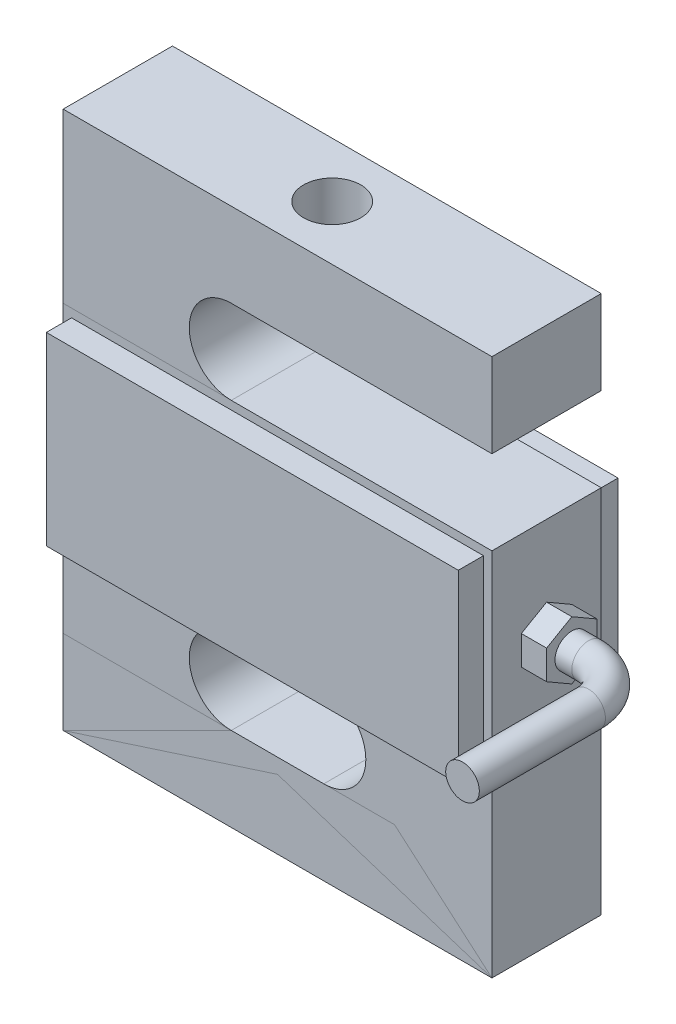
ISO-10303-21;
HEADER;
FILE_DESCRIPTION(('STEP AP214'),'2;1');
FILE_NAME('part.step','',(''),(''),'','','');
FILE_SCHEMA(('AUTOMOTIVE_DESIGN { 1 0 10303 214 1 1 1 1 }'));
ENDSEC;
DATA;
#1=APPLICATION_CONTEXT('core data for automotive mechanical design processes');
#2=APPLICATION_PROTOCOL_DEFINITION('international standard','automotive_design',2000,#1);
#3=PRODUCT_CONTEXT('',#1,'mechanical');
#4=PRODUCT('Part','Part','',(#3));
#5=PRODUCT_RELATED_PRODUCT_CATEGORY('part','',(#4));
#6=PRODUCT_DEFINITION_FORMATION('','',#4);
#7=PRODUCT_DEFINITION_CONTEXT('part definition',#1,'design');
#8=PRODUCT_DEFINITION('design','',#6,#7);
#9=PRODUCT_DEFINITION_SHAPE('','',#8);
#10=(LENGTH_UNIT() NAMED_UNIT(*) SI_UNIT(.MILLI.,.METRE.));
#11=(NAMED_UNIT(*) PLANE_ANGLE_UNIT() SI_UNIT($,.RADIAN.));
#12=(NAMED_UNIT(*) SI_UNIT($,.STERADIAN.) SOLID_ANGLE_UNIT());
#13=UNCERTAINTY_MEASURE_WITH_UNIT(LENGTH_MEASURE(1.E-05),#10,'distance_accuracy_value','');
#14=(GEOMETRIC_REPRESENTATION_CONTEXT(3) GLOBAL_UNCERTAINTY_ASSIGNED_CONTEXT((#13)) GLOBAL_UNIT_ASSIGNED_CONTEXT((#10,
#11,#12)) REPRESENTATION_CONTEXT('',''));
#15=CARTESIAN_POINT('',(0.,0.,0.));
#16=DIRECTION('',(0.,0.,1.));
#17=DIRECTION('',(1.,0.,0.));
#18=AXIS2_PLACEMENT_3D('',#15,#16,#17);
#19=CARTESIAN_POINT('',(35.5,0.,5.));
#20=DIRECTION('',(0.,0.,1.));
#21=DIRECTION('',(1.,0.,0.));
#22=AXIS2_PLACEMENT_3D('',#19,#20,#21);
#23=CYLINDRICAL_SURFACE('',#22,2.);
#24=CARTESIAN_POINT('',(35.5,0.,5.));
#25=DIRECTION('',(0.,0.,1.));
#26=DIRECTION('',(1.,0.,0.));
#27=AXIS2_PLACEMENT_3D('',#24,#25,#26);
#28=CIRCLE('',#27,2.);
#29=CARTESIAN_POINT('',(37.5,0.,5.));
#30=VERTEX_POINT('',#29);
#31=EDGE_CURVE('E48',#30,#30,#28,.T.);
#32=ORIENTED_EDGE('',*,*,#31,.T.);
#33=EDGE_LOOP('',(#32));
#34=FACE_BOUND('',#33,.T.);
#35=CARTESIAN_POINT('',(35.5,0.,20.));
#36=DIRECTION('',(0.,0.,1.));
#37=DIRECTION('',(1.,0.,0.));
#38=AXIS2_PLACEMENT_3D('',#35,#36,#37);
#39=CIRCLE('',#38,2.);
#40=CARTESIAN_POINT('',(37.5,0.,20.));
#41=VERTEX_POINT('',#40);
#42=EDGE_CURVE('E11',#41,#41,#39,.T.);
#43=ORIENTED_EDGE('',*,*,#42,.F.);
#44=EDGE_LOOP('',(#43));
#45=FACE_BOUND('',#44,.T.);
#46=ADVANCED_FACE('F42',(#34,#45),#23,.T.);
#47=CARTESIAN_POINT('',(30.5,0.,5.));
#48=DIRECTION('',(0.,-1.,0.));
#49=DIRECTION('',(0.,0.,-1.));
#50=AXIS2_PLACEMENT_3D('',#47,#48,#49);
#51=TOROIDAL_SURFACE('',#50,5.,2.);
#52=CARTESIAN_POINT('',(30.5,0.,0.));
#53=DIRECTION('',(1.,0.,0.));
#54=DIRECTION('',(0.,0.,-1.));
#55=AXIS2_PLACEMENT_3D('',#52,#53,#54);
#56=CIRCLE('',#55,2.);
#57=CARTESIAN_POINT('',(30.5,0.,-2.));
#58=VERTEX_POINT('',#57);
#59=EDGE_CURVE('E52',#58,#58,#56,.T.);
#60=CARTESIAN_POINT('',(30.5,0.,5.));
#61=DIRECTION('',(0.,-1.,0.));
#62=DIRECTION('',(0.,0.,-1.));
#63=AXIS2_PLACEMENT_3D('',#60,#61,#62);
#64=CIRCLE('',#63,7.);
#65=EDGE_CURVE('',#58,#30,#64,.T.);
#66=ORIENTED_EDGE('',*,*,#59,.T.);
#67=ORIENTED_EDGE('',*,*,#31,.F.);
#68=ORIENTED_EDGE('',*,*,#65,.T.);
#69=ORIENTED_EDGE('',*,*,#65,.F.);
#70=EDGE_LOOP('',(#66,#68,#67,#69));
#71=FACE_BOUND('',#70,.T.);
#72=ADVANCED_FACE('F73',(#71),#51,.T.);
#73=CARTESIAN_POINT('',(30.5,0.,0.));
#74=DIRECTION('',(-1.,0.,0.));
#75=DIRECTION('',(0.,0.,1.));
#76=AXIS2_PLACEMENT_3D('',#73,#74,#75);
#77=CYLINDRICAL_SURFACE('',#76,2.);
#78=ORIENTED_EDGE('',*,*,#59,.F.);
#79=EDGE_LOOP('',(#78));
#80=FACE_BOUND('',#79,.T.);
#81=CARTESIAN_POINT('',(28.5,0.,0.));
#82=DIRECTION('',(1.,0.,0.));
#83=DIRECTION('',(0.,0.,-1.));
#84=AXIS2_PLACEMENT_3D('',#81,#82,#83);
#85=CIRCLE('',#84,2.);
#86=CARTESIAN_POINT('',(28.5,0.,-2.));
#87=VERTEX_POINT('',#86);
#88=EDGE_CURVE('E56',#87,#87,#85,.T.);
#89=ORIENTED_EDGE('',*,*,#88,.T.);
#90=EDGE_LOOP('',(#89));
#91=FACE_BOUND('',#90,.T.);
#92=ADVANCED_FACE('F62',(#80,#91),#77,.T.);
#93=CARTESIAN_POINT('',(35.5,0.,20.));
#94=DIRECTION('',(0.,0.,1.));
#95=DIRECTION('',(1.,0.,0.));
#96=AXIS2_PLACEMENT_3D('',#93,#94,#95);
#97=PLANE('',#96);
#98=ORIENTED_EDGE('',*,*,#42,.T.);
#99=EDGE_LOOP('',(#98));
#100=FACE_BOUND('',#99,.T.);
#101=ADVANCED_FACE('F66',(#100),#97,.T.);
#102=CARTESIAN_POINT('',(28.5,0.,0.));
#103=DIRECTION('',(1.,0.,0.));
#104=DIRECTION('',(0.,0.,-1.));
#105=AXIS2_PLACEMENT_3D('',#102,#103,#104);
#106=PLANE('',#105);
#107=ORIENTED_EDGE('',*,*,#88,.F.);
#108=EDGE_LOOP('',(#107));
#109=FACE_BOUND('',#108,.T.);
#110=ADVANCED_FACE('F64',(#109),#106,.F.);
#111=CLOSED_SHELL('',(#46,#72,#92,#101,#110));
#112=MANIFOLD_SOLID_BREP('B2',#111);
#113=CARTESIAN_POINT('',(28.5,1.73205080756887,3.));
#114=DIRECTION('',(0.,0.,-1.));
#115=DIRECTION('',(-1.,0.,0.));
#116=AXIS2_PLACEMENT_3D('',#113,#114,#115);
#117=PLANE('',#116);
#118=DIRECTION('',(0.,-1.,0.));
#119=VECTOR('',#118,1.);
#120=CARTESIAN_POINT('',(25.5,1.73205080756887,3.));
#121=LINE('',#120,#119);
#122=CARTESIAN_POINT('',(25.5,1.73205080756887,3.));
#123=VERTEX_POINT('',#122);
#124=CARTESIAN_POINT('',(25.5,-1.73205080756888,3.));
#125=VERTEX_POINT('',#124);
#126=EDGE_CURVE('E179',#123,#125,#121,.T.);
#127=ORIENTED_EDGE('',*,*,#126,.T.);
#128=DIRECTION('',(-1.,0.,0.));
#129=VECTOR('',#128,1.);
#130=CARTESIAN_POINT('',(28.5,-1.73205080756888,3.));
#131=LINE('',#130,#129);
#132=CARTESIAN_POINT('',(28.5,-1.73205080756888,3.));
#133=VERTEX_POINT('',#132);
#134=EDGE_CURVE('E40',#133,#125,#131,.T.);
#135=ORIENTED_EDGE('',*,*,#134,.F.);
#136=DIRECTION('',(0.,-1.,0.));
#137=VECTOR('',#136,1.);
#138=CARTESIAN_POINT('',(28.5,1.73205080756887,3.));
#139=LINE('',#138,#137);
#140=CARTESIAN_POINT('',(28.5,1.73205080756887,3.));
#141=VERTEX_POINT('',#140);
#142=EDGE_CURVE('E202',#141,#133,#139,.T.);
#143=ORIENTED_EDGE('',*,*,#142,.F.);
#144=DIRECTION('',(-1.,0.,0.));
#145=VECTOR('',#144,1.);
#146=CARTESIAN_POINT('',(28.5,1.73205080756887,3.));
#147=LINE('',#146,#145);
#148=EDGE_CURVE('E192',#141,#123,#147,.T.);
#149=ORIENTED_EDGE('',*,*,#148,.T.);
#150=EDGE_LOOP('',(#127,#135,#143,#149));
#151=FACE_BOUND('',#150,.T.);
#152=ADVANCED_FACE('F123',(#151),#117,.F.);
#153=CARTESIAN_POINT('',(28.5,-1.73205080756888,3.));
#154=DIRECTION('',(0.,0.866025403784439,-0.5));
#155=DIRECTION('',(0.,0.5,0.866025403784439));
#156=AXIS2_PLACEMENT_3D('',#153,#154,#155);
#157=PLANE('',#156);
#158=DIRECTION('',(0.,-0.5,-0.866025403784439));
#159=VECTOR('',#158,1.);
#160=CARTESIAN_POINT('',(25.5,-1.73205080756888,3.));
#161=LINE('',#160,#159);
#162=CARTESIAN_POINT('',(25.5,-3.46410161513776,0.));
#163=VERTEX_POINT('',#162);
#164=EDGE_CURVE('E175',#125,#163,#161,.T.);
#165=ORIENTED_EDGE('',*,*,#164,.T.);
#166=DIRECTION('',(-1.,0.,0.));
#167=VECTOR('',#166,1.);
#168=CARTESIAN_POINT('',(28.5,-3.46410161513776,0.));
#169=LINE('',#168,#167);
#170=CARTESIAN_POINT('',(28.5,-3.46410161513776,0.));
#171=VERTEX_POINT('',#170);
#172=EDGE_CURVE('E130',#171,#163,#169,.T.);
#173=ORIENTED_EDGE('',*,*,#172,.F.);
#174=DIRECTION('',(0.,-0.5,-0.866025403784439));
#175=VECTOR('',#174,1.);
#176=CARTESIAN_POINT('',(28.5,-1.73205080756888,3.));
#177=LINE('',#176,#175);
#178=EDGE_CURVE('E188',#133,#171,#177,.T.);
#179=ORIENTED_EDGE('',*,*,#178,.F.);
#180=ORIENTED_EDGE('',*,*,#134,.T.);
#181=EDGE_LOOP('',(#165,#173,#179,#180));
#182=FACE_BOUND('',#181,.T.);
#183=ADVANCED_FACE('F187',(#182),#157,.F.);
#184=CARTESIAN_POINT('',(28.5,-3.46410161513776,0.));
#185=DIRECTION('',(0.,0.866025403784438,0.500000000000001));
#186=DIRECTION('',(0.,-0.500000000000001,0.866025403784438));
#187=AXIS2_PLACEMENT_3D('',#184,#185,#186);
#188=PLANE('',#187);
#189=DIRECTION('',(0.,0.500000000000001,-0.866025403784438));
#190=VECTOR('',#189,1.);
#191=CARTESIAN_POINT('',(25.5,-3.46410161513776,0.));
#192=LINE('',#191,#190);
#193=CARTESIAN_POINT('',(25.5,-1.73205080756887,-3.));
#194=VERTEX_POINT('',#193);
#195=EDGE_CURVE('E181',#163,#194,#192,.T.);
#196=ORIENTED_EDGE('',*,*,#195,.T.);
#197=DIRECTION('',(-1.,0.,0.));
#198=VECTOR('',#197,1.);
#199=CARTESIAN_POINT('',(28.5,-1.73205080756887,-3.));
#200=LINE('',#199,#198);
#201=CARTESIAN_POINT('',(28.5,-1.73205080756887,-3.));
#202=VERTEX_POINT('',#201);
#203=EDGE_CURVE('E218',#202,#194,#200,.T.);
#204=ORIENTED_EDGE('',*,*,#203,.F.);
#205=DIRECTION('',(0.,0.500000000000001,-0.866025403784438));
#206=VECTOR('',#205,1.);
#207=CARTESIAN_POINT('',(28.5,-3.46410161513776,0.));
#208=LINE('',#207,#206);
#209=EDGE_CURVE('E205',#171,#202,#208,.T.);
#210=ORIENTED_EDGE('',*,*,#209,.F.);
#211=ORIENTED_EDGE('',*,*,#172,.T.);
#212=EDGE_LOOP('',(#196,#204,#210,#211));
#213=FACE_BOUND('',#212,.T.);
#214=ADVANCED_FACE('F222',(#213),#188,.F.);
#215=CARTESIAN_POINT('',(28.5,-1.73205080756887,-3.));
#216=DIRECTION('',(0.,0.,1.));
#217=DIRECTION('',(1.,0.,0.));
#218=AXIS2_PLACEMENT_3D('',#215,#216,#217);
#219=PLANE('',#218);
#220=DIRECTION('',(0.,1.,0.));
#221=VECTOR('',#220,1.);
#222=CARTESIAN_POINT('',(25.5,-1.73205080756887,-3.));
#223=LINE('',#222,#221);
#224=CARTESIAN_POINT('',(25.5,1.73205080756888,-3.));
#225=VERTEX_POINT('',#224);
#226=EDGE_CURVE('E196',#194,#225,#223,.T.);
#227=ORIENTED_EDGE('',*,*,#226,.T.);
#228=DIRECTION('',(-1.,0.,0.));
#229=VECTOR('',#228,1.);
#230=CARTESIAN_POINT('',(28.5,1.73205080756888,-3.));
#231=LINE('',#230,#229);
#232=CARTESIAN_POINT('',(28.5,1.73205080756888,-3.));
#233=VERTEX_POINT('',#232);
#234=EDGE_CURVE('E215',#233,#225,#231,.T.);
#235=ORIENTED_EDGE('',*,*,#234,.F.);
#236=DIRECTION('',(0.,1.,0.));
#237=VECTOR('',#236,1.);
#238=CARTESIAN_POINT('',(28.5,-1.73205080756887,-3.));
#239=LINE('',#238,#237);
#240=EDGE_CURVE('E207',#202,#233,#239,.T.);
#241=ORIENTED_EDGE('',*,*,#240,.F.);
#242=ORIENTED_EDGE('',*,*,#203,.T.);
#243=EDGE_LOOP('',(#227,#235,#241,#242));
#244=FACE_BOUND('',#243,.T.);
#245=ADVANCED_FACE('F228',(#244),#219,.F.);
#246=CARTESIAN_POINT('',(28.5,1.73205080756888,-3.));
#247=DIRECTION('',(0.,-0.866025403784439,0.5));
#248=DIRECTION('',(0.,-0.5,-0.866025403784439));
#249=AXIS2_PLACEMENT_3D('',#246,#247,#248);
#250=PLANE('',#249);
#251=DIRECTION('',(0.,0.5,0.866025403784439));
#252=VECTOR('',#251,1.);
#253=CARTESIAN_POINT('',(25.5,1.73205080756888,-3.));
#254=LINE('',#253,#252);
#255=CARTESIAN_POINT('',(25.5,3.46410161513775,0.));
#256=VERTEX_POINT('',#255);
#257=EDGE_CURVE('E198',#225,#256,#254,.T.);
#258=ORIENTED_EDGE('',*,*,#257,.T.);
#259=DIRECTION('',(-1.,0.,0.));
#260=VECTOR('',#259,1.);
#261=CARTESIAN_POINT('',(28.5,3.46410161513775,0.));
#262=LINE('',#261,#260);
#263=CARTESIAN_POINT('',(28.5,3.46410161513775,0.));
#264=VERTEX_POINT('',#263);
#265=EDGE_CURVE('E212',#264,#256,#262,.T.);
#266=ORIENTED_EDGE('',*,*,#265,.F.);
#267=DIRECTION('',(0.,0.5,0.866025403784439));
#268=VECTOR('',#267,1.);
#269=CARTESIAN_POINT('',(28.5,1.73205080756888,-3.));
#270=LINE('',#269,#268);
#271=EDGE_CURVE('E142',#233,#264,#270,.T.);
#272=ORIENTED_EDGE('',*,*,#271,.F.);
#273=ORIENTED_EDGE('',*,*,#234,.T.);
#274=EDGE_LOOP('',(#258,#266,#272,#273));
#275=FACE_BOUND('',#274,.T.);
#276=ADVANCED_FACE('F231',(#275),#250,.F.);
#277=CARTESIAN_POINT('',(28.5,3.46410161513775,0.));
#278=DIRECTION('',(0.,-0.866025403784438,-0.5));
#279=DIRECTION('',(0.,0.5,-0.866025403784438));
#280=AXIS2_PLACEMENT_3D('',#277,#278,#279);
#281=PLANE('',#280);
#282=DIRECTION('',(0.,-0.5,0.866025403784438));
#283=VECTOR('',#282,1.);
#284=CARTESIAN_POINT('',(25.5,3.46410161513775,0.));
#285=LINE('',#284,#283);
#286=EDGE_CURVE('E200',#256,#123,#285,.T.);
#287=ORIENTED_EDGE('',*,*,#286,.T.);
#288=ORIENTED_EDGE('',*,*,#148,.F.);
#289=DIRECTION('',(0.,-0.5,0.866025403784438));
#290=VECTOR('',#289,1.);
#291=CARTESIAN_POINT('',(28.5,3.46410161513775,0.));
#292=LINE('',#291,#290);
#293=EDGE_CURVE('E137',#264,#141,#292,.T.);
#294=ORIENTED_EDGE('',*,*,#293,.F.);
#295=ORIENTED_EDGE('',*,*,#265,.T.);
#296=EDGE_LOOP('',(#287,#288,#294,#295));
#297=FACE_BOUND('',#296,.T.);
#298=ADVANCED_FACE('F233',(#297),#281,.F.);
#299=CARTESIAN_POINT('',(28.5,5.19615242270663,3.));
#300=DIRECTION('',(-1.,0.,0.));
#301=DIRECTION('',(0.,0.,1.));
#302=AXIS2_PLACEMENT_3D('',#299,#300,#301);
#303=PLANE('',#302);
#304=ORIENTED_EDGE('',*,*,#142,.T.);
#305=ORIENTED_EDGE('',*,*,#178,.T.);
#306=ORIENTED_EDGE('',*,*,#209,.T.);
#307=ORIENTED_EDGE('',*,*,#240,.T.);
#308=ORIENTED_EDGE('',*,*,#271,.T.);
#309=ORIENTED_EDGE('',*,*,#293,.T.);
#310=EDGE_LOOP('',(#304,#305,#306,#307,#308,#309));
#311=FACE_BOUND('',#310,.T.);
#312=ADVANCED_FACE('F225',(#311),#303,.F.);
#313=CARTESIAN_POINT('',(25.5,5.19615242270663,3.));
#314=DIRECTION('',(-1.,0.,0.));
#315=DIRECTION('',(0.,0.,1.));
#316=AXIS2_PLACEMENT_3D('',#313,#314,#315);
#317=PLANE('',#316);
#318=ORIENTED_EDGE('',*,*,#126,.F.);
#319=ORIENTED_EDGE('',*,*,#286,.F.);
#320=ORIENTED_EDGE('',*,*,#257,.F.);
#321=ORIENTED_EDGE('',*,*,#226,.F.);
#322=ORIENTED_EDGE('',*,*,#195,.F.);
#323=ORIENTED_EDGE('',*,*,#164,.F.);
#324=EDGE_LOOP('',(#318,#319,#320,#321,#322,#323));
#325=FACE_BOUND('',#324,.T.);
#326=ADVANCED_FACE('F176',(#325),#317,.T.);
#327=CLOSED_SHELL('',(#152,#183,#214,#245,#276,#298,#312,#326));
#328=MANIFOLD_SOLID_BREP('B6',#327);
#329=CARTESIAN_POINT('',(24.5,11.,-9.5));
#330=DIRECTION('',(-1.,0.,0.));
#331=DIRECTION('',(0.,-1.,0.));
#332=AXIS2_PLACEMENT_3D('',#329,#330,#331);
#333=PLANE('',#332);
#334=DIRECTION('',(0.,-1.,0.));
#335=VECTOR('',#334,1.);
#336=CARTESIAN_POINT('',(24.5,11.,-6.5));
#337=LINE('',#336,#335);
#338=CARTESIAN_POINT('',(24.5,11.,-6.5));
#339=VERTEX_POINT('',#338);
#340=CARTESIAN_POINT('',(24.5,-11.,-6.5));
#341=VERTEX_POINT('',#340);
#342=EDGE_CURVE('E353',#339,#341,#337,.T.);
#343=ORIENTED_EDGE('',*,*,#342,.T.);
#344=DIRECTION('',(0.,0.,1.));
#345=VECTOR('',#344,1.);
#346=CARTESIAN_POINT('',(24.5,-11.,-9.5));
#347=LINE('',#346,#345);
#348=CARTESIAN_POINT('',(24.5,-11.,-9.5));
#349=VERTEX_POINT('',#348);
#350=EDGE_CURVE('E121',#349,#341,#347,.T.);
#351=ORIENTED_EDGE('',*,*,#350,.F.);
#352=DIRECTION('',(0.,-1.,0.));
#353=VECTOR('',#352,1.);
#354=CARTESIAN_POINT('',(24.5,11.,-9.5));
#355=LINE('',#354,#353);
#356=CARTESIAN_POINT('',(24.5,11.,-9.5));
#357=VERTEX_POINT('',#356);
#358=EDGE_CURVE('E371',#357,#349,#355,.T.);
#359=ORIENTED_EDGE('',*,*,#358,.F.);
#360=DIRECTION('',(0.,0.,1.));
#361=VECTOR('',#360,1.);
#362=CARTESIAN_POINT('',(24.5,11.,-9.5));
#363=LINE('',#362,#361);
#364=EDGE_CURVE('E365',#357,#339,#363,.T.);
#365=ORIENTED_EDGE('',*,*,#364,.T.);
#366=EDGE_LOOP('',(#343,#351,#359,#365));
#367=FACE_BOUND('',#366,.T.);
#368=ADVANCED_FACE('F309',(#367),#333,.F.);
#369=CARTESIAN_POINT('',(24.5,-11.,-9.5));
#370=DIRECTION('',(0.,1.,0.));
#371=DIRECTION('',(0.,0.,1.));
#372=AXIS2_PLACEMENT_3D('',#369,#370,#371);
#373=PLANE('',#372);
#374=DIRECTION('',(-1.,0.,0.));
#375=VECTOR('',#374,1.);
#376=CARTESIAN_POINT('',(24.5,-11.,-6.5));
#377=LINE('',#376,#375);
#378=CARTESIAN_POINT('',(-24.5,-11.,-6.5));
#379=VERTEX_POINT('',#378);
#380=EDGE_CURVE('E349',#341,#379,#377,.T.);
#381=ORIENTED_EDGE('',*,*,#380,.T.);
#382=DIRECTION('',(0.,0.,1.));
#383=VECTOR('',#382,1.);
#384=CARTESIAN_POINT('',(-24.5,-11.,-9.5));
#385=LINE('',#384,#383);
#386=CARTESIAN_POINT('',(-24.5,-11.,-9.5));
#387=VERTEX_POINT('',#386);
#388=EDGE_CURVE('E316',#387,#379,#385,.T.);
#389=ORIENTED_EDGE('',*,*,#388,.F.);
#390=DIRECTION('',(-1.,0.,0.));
#391=VECTOR('',#390,1.);
#392=CARTESIAN_POINT('',(24.5,-11.,-9.5));
#393=LINE('',#392,#391);
#394=EDGE_CURVE('E361',#349,#387,#393,.T.);
#395=ORIENTED_EDGE('',*,*,#394,.F.);
#396=ORIENTED_EDGE('',*,*,#350,.T.);
#397=EDGE_LOOP('',(#381,#389,#395,#396));
#398=FACE_BOUND('',#397,.T.);
#399=ADVANCED_FACE('F360',(#398),#373,.F.);
#400=CARTESIAN_POINT('',(-24.5,11.,-9.5));
#401=DIRECTION('',(1.,0.,0.));
#402=DIRECTION('',(0.,1.,0.));
#403=AXIS2_PLACEMENT_3D('',#400,#401,#402);
#404=PLANE('',#403);
#405=DIRECTION('',(0.,1.,0.));
#406=VECTOR('',#405,1.);
#407=CARTESIAN_POINT('',(-24.5,11.,-6.5));
#408=LINE('',#407,#406);
#409=CARTESIAN_POINT('',(-24.5,11.,-6.5));
#410=VERTEX_POINT('',#409);
#411=EDGE_CURVE('E354',#379,#410,#408,.T.);
#412=ORIENTED_EDGE('',*,*,#411,.T.);
#413=DIRECTION('',(0.,0.,1.));
#414=VECTOR('',#413,1.);
#415=CARTESIAN_POINT('',(-24.5,11.,-9.5));
#416=LINE('',#415,#414);
#417=CARTESIAN_POINT('',(-24.5,11.,-9.5));
#418=VERTEX_POINT('',#417);
#419=EDGE_CURVE('E377',#418,#410,#416,.T.);
#420=ORIENTED_EDGE('',*,*,#419,.F.);
#421=DIRECTION('',(0.,1.,0.));
#422=VECTOR('',#421,1.);
#423=CARTESIAN_POINT('',(-24.5,11.,-9.5));
#424=LINE('',#423,#422);
#425=EDGE_CURVE('E328',#387,#418,#424,.T.);
#426=ORIENTED_EDGE('',*,*,#425,.F.);
#427=ORIENTED_EDGE('',*,*,#388,.T.);
#428=EDGE_LOOP('',(#412,#420,#426,#427));
#429=FACE_BOUND('',#428,.T.);
#430=ADVANCED_FACE('F380',(#429),#404,.F.);
#431=CARTESIAN_POINT('',(24.5,11.,-9.5));
#432=DIRECTION('',(0.,-1.,0.));
#433=DIRECTION('',(0.,0.,-1.));
#434=AXIS2_PLACEMENT_3D('',#431,#432,#433);
#435=PLANE('',#434);
#436=DIRECTION('',(1.,0.,0.));
#437=VECTOR('',#436,1.);
#438=CARTESIAN_POINT('',(24.5,11.,-6.5));
#439=LINE('',#438,#437);
#440=EDGE_CURVE('E369',#410,#339,#439,.T.);
#441=ORIENTED_EDGE('',*,*,#440,.T.);
#442=ORIENTED_EDGE('',*,*,#364,.F.);
#443=DIRECTION('',(1.,0.,0.));
#444=VECTOR('',#443,1.);
#445=CARTESIAN_POINT('',(24.5,11.,-9.5));
#446=LINE('',#445,#444);
#447=EDGE_CURVE('E323',#418,#357,#446,.T.);
#448=ORIENTED_EDGE('',*,*,#447,.F.);
#449=ORIENTED_EDGE('',*,*,#419,.T.);
#450=EDGE_LOOP('',(#441,#442,#448,#449));
#451=FACE_BOUND('',#450,.T.);
#452=ADVANCED_FACE('F382',(#451),#435,.F.);
#453=CARTESIAN_POINT('',(24.5,-11.,-9.5));
#454=DIRECTION('',(0.,0.,-1.));
#455=DIRECTION('',(-1.,0.,0.));
#456=AXIS2_PLACEMENT_3D('',#453,#454,#455);
#457=PLANE('',#456);
#458=ORIENTED_EDGE('',*,*,#358,.T.);
#459=ORIENTED_EDGE('',*,*,#394,.T.);
#460=ORIENTED_EDGE('',*,*,#425,.T.);
#461=ORIENTED_EDGE('',*,*,#447,.T.);
#462=EDGE_LOOP('',(#458,#459,#460,#461));
#463=FACE_BOUND('',#462,.T.);
#464=ADVANCED_FACE('F383',(#463),#457,.T.);
#465=CARTESIAN_POINT('',(24.5,-11.,-6.5));
#466=DIRECTION('',(0.,0.,-1.));
#467=DIRECTION('',(-1.,0.,0.));
#468=AXIS2_PLACEMENT_3D('',#465,#466,#467);
#469=PLANE('',#468);
#470=ORIENTED_EDGE('',*,*,#342,.F.);
#471=ORIENTED_EDGE('',*,*,#440,.F.);
#472=ORIENTED_EDGE('',*,*,#411,.F.);
#473=ORIENTED_EDGE('',*,*,#380,.F.);
#474=EDGE_LOOP('',(#470,#471,#472,#473));
#475=FACE_BOUND('',#474,.T.);
#476=ADVANCED_FACE('F350',(#475),#469,.F.);
#477=CLOSED_SHELL('',(#368,#399,#430,#452,#464,#476));
#478=MANIFOLD_SOLID_BREP('B34',#477);
#479=CARTESIAN_POINT('',(5.5,-12.,-61.2813836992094));
#480=DIRECTION('',(0.,1.,0.));
#481=DIRECTION('',(0.,0.,-1.));
#482=AXIS2_PLACEMENT_3D('',#479,#480,#481);
#483=PLANE('',#482);
#484=DIRECTION('',(1.,0.,0.));
#485=VECTOR('',#484,1.);
#486=CARTESIAN_POINT('',(5.5,-12.,-6.5));
#487=LINE('',#486,#485);
#488=CARTESIAN_POINT('',(5.5,-12.,-6.5));
#489=VERTEX_POINT('',#488);
#490=CARTESIAN_POINT('',(25.5,-12.,-6.5));
#491=VERTEX_POINT('',#490);
#492=EDGE_CURVE('E452',#489,#491,#487,.T.);
#493=ORIENTED_EDGE('',*,*,#492,.F.);
#494=DIRECTION('',(0.,0.,1.));
#495=VECTOR('',#494,1.);
#496=CARTESIAN_POINT('',(5.5,-12.,-61.2813836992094));
#497=LINE('',#496,#495);
#498=CARTESIAN_POINT('',(5.5,-12.,6.5));
#499=VERTEX_POINT('',#498);
#500=EDGE_CURVE('E520',#489,#499,#497,.T.);
#501=ORIENTED_EDGE('',*,*,#500,.T.);
#502=DIRECTION('',(-1.,0.,0.));
#503=VECTOR('',#502,1.);
#504=CARTESIAN_POINT('',(5.5,-12.,6.5));
#505=LINE('',#504,#503);
#506=CARTESIAN_POINT('',(25.5,-12.,6.5));
#507=VERTEX_POINT('',#506);
#508=EDGE_CURVE('E504',#507,#499,#505,.T.);
#509=ORIENTED_EDGE('',*,*,#508,.F.);
#510=DIRECTION('',(0.,0.,1.));
#511=VECTOR('',#510,1.);
#512=CARTESIAN_POINT('',(25.5,-12.,-61.2813836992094));
#513=LINE('',#512,#511);
#514=EDGE_CURVE('E521',#491,#507,#513,.T.);
#515=ORIENTED_EDGE('',*,*,#514,.F.);
#516=EDGE_LOOP('',(#493,#501,#509,#515));
#517=FACE_BOUND('',#516,.T.);
#518=ADVANCED_FACE('F443',(#517),#483,.T.);
#519=CARTESIAN_POINT('',(25.5,-12.,-61.2813836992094));
#520=DIRECTION('',(1.,0.,0.));
#521=DIRECTION('',(0.,1.,0.));
#522=AXIS2_PLACEMENT_3D('',#519,#520,#521);
#523=PLANE('',#522);
#524=DIRECTION('',(0.,-1.,0.));
#525=VECTOR('',#524,1.);
#526=CARTESIAN_POINT('',(25.5,-12.,-6.5));
#527=LINE('',#526,#525);
#528=CARTESIAN_POINT('',(25.5,-32.,-6.5));
#529=VERTEX_POINT('',#528);
#530=EDGE_CURVE('E498',#491,#529,#527,.T.);
#531=ORIENTED_EDGE('',*,*,#530,.F.);
#532=ORIENTED_EDGE('',*,*,#514,.T.);
#533=DIRECTION('',(0.,1.,0.));
#534=VECTOR('',#533,1.);
#535=CARTESIAN_POINT('',(25.5,-12.,6.5));
#536=LINE('',#535,#534);
#537=CARTESIAN_POINT('',(25.5,-32.,6.5));
#538=VERTEX_POINT('',#537);
#539=EDGE_CURVE('E517',#538,#507,#536,.T.);
#540=ORIENTED_EDGE('',*,*,#539,.F.);
#541=DIRECTION('',(0.,0.,1.));
#542=VECTOR('',#541,1.);
#543=CARTESIAN_POINT('',(25.5,-32.,-61.2813836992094));
#544=LINE('',#543,#542);
#545=EDGE_CURVE('E493',#529,#538,#544,.T.);
#546=ORIENTED_EDGE('',*,*,#545,.F.);
#547=EDGE_LOOP('',(#531,#532,#540,#546));
#548=FACE_BOUND('',#547,.T.);
#549=ADVANCED_FACE('F548',(#548),#523,.T.);
#550=CARTESIAN_POINT('',(25.5,-32.,-61.2813836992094));
#551=DIRECTION('',(0.,-1.,0.));
#552=DIRECTION('',(0.,0.,1.));
#553=AXIS2_PLACEMENT_3D('',#550,#551,#552);
#554=PLANE('',#553);
#555=CARTESIAN_POINT('',(0.,-32.,0.));
#556=DIRECTION('',(0.,-1.,0.));
#557=DIRECTION('',(0.,0.,-1.));
#558=AXIS2_PLACEMENT_3D('',#555,#556,#557);
#559=CIRCLE('',#558,3.39999999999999);
#560=CARTESIAN_POINT('',(0.,-32.,-3.39999999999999));
#561=VERTEX_POINT('',#560);
#562=EDGE_CURVE('E557',#561,#561,#559,.T.);
#563=ORIENTED_EDGE('',*,*,#562,.F.);
#564=EDGE_LOOP('',(#563));
#565=FACE_BOUND('',#564,.T.);
#566=DIRECTION('',(-1.,0.,0.));
#567=VECTOR('',#566,1.);
#568=CARTESIAN_POINT('',(25.5,-32.,-6.5));
#569=LINE('',#568,#567);
#570=CARTESIAN_POINT('',(-25.5,-32.,-6.5));
#571=VERTEX_POINT('',#570);
#572=EDGE_CURVE('E484',#529,#571,#569,.T.);
#573=ORIENTED_EDGE('',*,*,#572,.F.);
#574=ORIENTED_EDGE('',*,*,#545,.T.);
#575=DIRECTION('',(1.,0.,0.));
#576=VECTOR('',#575,1.);
#577=CARTESIAN_POINT('',(25.5,-32.,6.5));
#578=LINE('',#577,#576);
#579=CARTESIAN_POINT('',(-25.5,-32.,6.5));
#580=VERTEX_POINT('',#579);
#581=EDGE_CURVE('E492',#580,#538,#578,.T.);
#582=ORIENTED_EDGE('',*,*,#581,.F.);
#583=DIRECTION('',(0.,0.,1.));
#584=VECTOR('',#583,1.);
#585=CARTESIAN_POINT('',(-25.5,-32.,-61.2813836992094));
#586=LINE('',#585,#584);
#587=EDGE_CURVE('E479',#571,#580,#586,.T.);
#588=ORIENTED_EDGE('',*,*,#587,.F.);
#589=EDGE_LOOP('',(#573,#574,#582,#588));
#590=FACE_BOUND('',#589,.T.);
#591=ADVANCED_FACE('F488',(#565,#590),#554,.T.);
#592=CARTESIAN_POINT('',(-25.5,-32.,-61.2813836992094));
#593=DIRECTION('',(-1.,0.,0.));
#594=DIRECTION('',(0.,0.,-1.));
#595=AXIS2_PLACEMENT_3D('',#592,#593,#594);
#596=PLANE('',#595);
#597=DIRECTION('',(0.,1.,0.));
#598=VECTOR('',#597,1.);
#599=CARTESIAN_POINT('',(-25.5,-32.,-6.5));
#600=LINE('',#599,#598);
#601=CARTESIAN_POINT('',(-25.5,-22.,-6.5));
#602=VERTEX_POINT('',#601);
#603=EDGE_CURVE('E474',#571,#602,#600,.T.);
#604=ORIENTED_EDGE('',*,*,#603,.F.);
#605=ORIENTED_EDGE('',*,*,#587,.T.);
#606=DIRECTION('',(0.,-1.,0.));
#607=VECTOR('',#606,1.);
#608=CARTESIAN_POINT('',(-25.5,-32.,6.5));
#609=LINE('',#608,#607);
#610=CARTESIAN_POINT('',(-25.5,-22.,6.5));
#611=VERTEX_POINT('',#610);
#612=EDGE_CURVE('E513',#611,#580,#609,.T.);
#613=ORIENTED_EDGE('',*,*,#612,.F.);
#614=DIRECTION('',(0.,0.,1.));
#615=VECTOR('',#614,1.);
#616=CARTESIAN_POINT('',(-25.5,-22.,-61.2813836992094));
#617=LINE('',#616,#615);
#618=EDGE_CURVE('E482',#602,#611,#617,.T.);
#619=ORIENTED_EDGE('',*,*,#618,.F.);
#620=EDGE_LOOP('',(#604,#605,#613,#619));
#621=FACE_BOUND('',#620,.T.);
#622=ADVANCED_FACE('F476',(#621),#596,.T.);
#623=CARTESIAN_POINT('',(-25.5,-22.,-61.2813836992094));
#624=DIRECTION('',(0.,1.,0.));
#625=DIRECTION('',(-1.,0.,0.));
#626=AXIS2_PLACEMENT_3D('',#623,#624,#625);
#627=PLANE('',#626);
#628=CARTESIAN_POINT('',(0.,-22.,0.));
#629=DIRECTION('',(0.,1.,0.));
#630=DIRECTION('',(-1.,0.,0.));
#631=AXIS2_PLACEMENT_3D('',#628,#629,#630);
#632=CIRCLE('',#631,3.39999999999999);
#633=CARTESIAN_POINT('',(-3.39999999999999,-22.,0.));
#634=VERTEX_POINT('',#633);
#635=EDGE_CURVE('E446',#634,#634,#632,.T.);
#636=ORIENTED_EDGE('',*,*,#635,.F.);
#637=EDGE_LOOP('',(#636));
#638=FACE_BOUND('',#637,.T.);
#639=DIRECTION('',(1.,0.,0.));
#640=VECTOR('',#639,1.);
#641=CARTESIAN_POINT('',(-25.5,-22.,-6.5));
#642=LINE('',#641,#640);
#643=CARTESIAN_POINT('',(5.5,-22.,-6.5));
#644=VERTEX_POINT('',#643);
#645=EDGE_CURVE('E485',#602,#644,#642,.T.);
#646=ORIENTED_EDGE('',*,*,#645,.F.);
#647=ORIENTED_EDGE('',*,*,#618,.T.);
#648=DIRECTION('',(-1.,0.,0.));
#649=VECTOR('',#648,1.);
#650=CARTESIAN_POINT('',(-25.5,-22.,6.5));
#651=LINE('',#650,#649);
#652=CARTESIAN_POINT('',(5.5,-22.,6.5));
#653=VERTEX_POINT('',#652);
#654=EDGE_CURVE('E510',#653,#611,#651,.T.);
#655=ORIENTED_EDGE('',*,*,#654,.F.);
#656=DIRECTION('',(0.,0.,1.));
#657=VECTOR('',#656,1.);
#658=CARTESIAN_POINT('',(5.5,-22.,-61.2813836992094));
#659=LINE('',#658,#657);
#660=EDGE_CURVE('E526',#644,#653,#659,.T.);
#661=ORIENTED_EDGE('',*,*,#660,.F.);
#662=EDGE_LOOP('',(#646,#647,#655,#661));
#663=FACE_BOUND('',#662,.T.);
#664=ADVANCED_FACE('F555',(#638,#663),#627,.T.);
#665=CARTESIAN_POINT('',(5.5,-17.,-61.2813836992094));
#666=DIRECTION('',(0.,0.,1.));
#667=DIRECTION('',(-1.,0.,0.));
#668=AXIS2_PLACEMENT_3D('',#665,#666,#667);
#669=CYLINDRICAL_SURFACE('',#668,5.);
#670=CARTESIAN_POINT('',(5.5,-17.,-6.5));
#671=DIRECTION('',(0.,0.,1.));
#672=DIRECTION('',(-1.,0.,0.));
#673=AXIS2_PLACEMENT_3D('',#670,#671,#672);
#674=CIRCLE('',#673,5.);
#675=EDGE_CURVE('E307',#644,#489,#674,.T.);
#676=ORIENTED_EDGE('',*,*,#675,.F.);
#677=ORIENTED_EDGE('',*,*,#660,.T.);
#678=CARTESIAN_POINT('',(5.5,-17.,6.5));
#679=DIRECTION('',(0.,0.,-1.));
#680=DIRECTION('',(-1.,0.,0.));
#681=AXIS2_PLACEMENT_3D('',#678,#679,#680);
#682=CIRCLE('',#681,5.);
#683=EDGE_CURVE('E507',#499,#653,#682,.T.);
#684=ORIENTED_EDGE('',*,*,#683,.F.);
#685=ORIENTED_EDGE('',*,*,#500,.F.);
#686=EDGE_LOOP('',(#676,#677,#684,#685));
#687=FACE_BOUND('',#686,.T.);
#688=ADVANCED_FACE('F540',(#687),#669,.F.);
#689=CARTESIAN_POINT('',(5.5,-17.,6.5));
#690=DIRECTION('',(0.,0.,1.));
#691=DIRECTION('',(-1.,0.,0.));
#692=AXIS2_PLACEMENT_3D('',#689,#690,#691);
#693=PLANE('',#692);
#694=ORIENTED_EDGE('',*,*,#508,.T.);
#695=ORIENTED_EDGE('',*,*,#683,.T.);
#696=ORIENTED_EDGE('',*,*,#654,.T.);
#697=ORIENTED_EDGE('',*,*,#612,.T.);
#698=ORIENTED_EDGE('',*,*,#581,.T.);
#699=ORIENTED_EDGE('',*,*,#539,.T.);
#700=EDGE_LOOP('',(#694,#695,#696,#697,#698,#699));
#701=FACE_BOUND('',#700,.T.);
#702=ADVANCED_FACE('F544',(#701),#693,.T.);
#703=CARTESIAN_POINT('',(25.5,12.,-6.5));
#704=DIRECTION('',(0.,0.,1.));
#705=DIRECTION('',(-1.,0.,0.));
#706=AXIS2_PLACEMENT_3D('',#703,#704,#705);
#707=PLANE('',#706);
#708=ORIENTED_EDGE('',*,*,#492,.T.);
#709=ORIENTED_EDGE('',*,*,#530,.T.);
#710=ORIENTED_EDGE('',*,*,#572,.T.);
#711=ORIENTED_EDGE('',*,*,#603,.T.);
#712=ORIENTED_EDGE('',*,*,#645,.T.);
#713=ORIENTED_EDGE('',*,*,#675,.T.);
#714=EDGE_LOOP('',(#708,#709,#710,#711,#712,#713));
#715=FACE_BOUND('',#714,.T.);
#716=ADVANCED_FACE('F496',(#715),#707,.F.);
#717=CARTESIAN_POINT('',(0.,-32.,0.));
#718=DIRECTION('',(0.,-1.,0.));
#719=DIRECTION('',(0.,0.,-1.));
#720=AXIS2_PLACEMENT_3D('',#717,#718,#719);
#721=CYLINDRICAL_SURFACE('',#720,3.39999999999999);
#722=ORIENTED_EDGE('',*,*,#635,.T.);
#723=EDGE_LOOP('',(#722));
#724=FACE_BOUND('',#723,.T.);
#725=ORIENTED_EDGE('',*,*,#562,.T.);
#726=EDGE_LOOP('',(#725));
#727=FACE_BOUND('',#726,.T.);
#728=ADVANCED_FACE('F564',(#724,#727),#721,.F.);
#729=CLOSED_SHELL('',(#518,#549,#591,#622,#664,#688,#702,#716,#728));
#730=MANIFOLD_SOLID_BREP('B115',#729);
#731=CARTESIAN_POINT('',(-5.5,-12.,-61.2813836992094));
#732=DIRECTION('',(0.,1.,0.));
#733=DIRECTION('',(0.,0.,-1.));
#734=AXIS2_PLACEMENT_3D('',#731,#732,#733);
#735=PLANE('',#734);
#736=DIRECTION('',(-1.,0.,0.));
#737=VECTOR('',#736,1.);
#738=CARTESIAN_POINT('',(-5.5,-12.,-6.5));
#739=LINE('',#738,#737);
#740=CARTESIAN_POINT('',(-5.5,-12.,-6.5));
#741=VERTEX_POINT('',#740);
#742=CARTESIAN_POINT('',(-25.5,-12.,-6.5));
#743=VERTEX_POINT('',#742);
#744=EDGE_CURVE('E658',#741,#743,#739,.T.);
#745=ORIENTED_EDGE('',*,*,#744,.T.);
#746=DIRECTION('',(0.,0.,1.));
#747=VECTOR('',#746,1.);
#748=CARTESIAN_POINT('',(-25.5,-12.,-61.2813836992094));
#749=LINE('',#748,#747);
#750=CARTESIAN_POINT('',(-25.5,-12.,6.5));
#751=VERTEX_POINT('',#750);
#752=EDGE_CURVE('E731',#743,#751,#749,.T.);
#753=ORIENTED_EDGE('',*,*,#752,.T.);
#754=DIRECTION('',(1.,0.,0.));
#755=VECTOR('',#754,1.);
#756=CARTESIAN_POINT('',(-5.5,-12.,6.5));
#757=LINE('',#756,#755);
#758=CARTESIAN_POINT('',(-5.5,-12.,6.5));
#759=VERTEX_POINT('',#758);
#760=EDGE_CURVE('E715',#751,#759,#757,.T.);
#761=ORIENTED_EDGE('',*,*,#760,.T.);
#762=DIRECTION('',(0.,0.,1.));
#763=VECTOR('',#762,1.);
#764=CARTESIAN_POINT('',(-5.5,-12.,-61.2813836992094));
#765=LINE('',#764,#763);
#766=EDGE_CURVE('E730',#741,#759,#765,.T.);
#767=ORIENTED_EDGE('',*,*,#766,.F.);
#768=EDGE_LOOP('',(#745,#753,#761,#767));
#769=FACE_BOUND('',#768,.T.);
#770=ADVANCED_FACE('F650',(#769),#735,.T.);
#771=CARTESIAN_POINT('',(-25.5,-12.,-61.2813836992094));
#772=DIRECTION('',(-1.,0.,0.));
#773=DIRECTION('',(0.,1.,0.));
#774=AXIS2_PLACEMENT_3D('',#771,#772,#773);
#775=PLANE('',#774);
#776=DIRECTION('',(0.,-1.,0.));
#777=VECTOR('',#776,1.);
#778=CARTESIAN_POINT('',(-25.5,-12.,-6.5));
#779=LINE('',#778,#777);
#780=CARTESIAN_POINT('',(-25.5,-32.,-6.5));
#781=VERTEX_POINT('',#780);
#782=EDGE_CURVE('E708',#743,#781,#779,.T.);
#783=ORIENTED_EDGE('',*,*,#782,.T.);
#784=DIRECTION('',(0.,0.,1.));
#785=VECTOR('',#784,1.);
#786=CARTESIAN_POINT('',(-25.5,-32.,-61.2813836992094));
#787=LINE('',#786,#785);
#788=CARTESIAN_POINT('',(-25.5,-32.,6.5));
#789=VERTEX_POINT('',#788);
#790=EDGE_CURVE('E702',#781,#789,#787,.T.);
#791=ORIENTED_EDGE('',*,*,#790,.T.);
#792=DIRECTION('',(0.,1.,0.));
#793=VECTOR('',#792,1.);
#794=CARTESIAN_POINT('',(-25.5,-12.,6.5));
#795=LINE('',#794,#793);
#796=EDGE_CURVE('E727',#789,#751,#795,.T.);
#797=ORIENTED_EDGE('',*,*,#796,.T.);
#798=ORIENTED_EDGE('',*,*,#752,.F.);
#799=EDGE_LOOP('',(#783,#791,#797,#798));
#800=FACE_BOUND('',#799,.T.);
#801=ADVANCED_FACE('F768',(#800),#775,.T.);
#802=CARTESIAN_POINT('',(-25.5,-32.,-61.2813836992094));
#803=DIRECTION('',(0.,-1.,0.));
#804=DIRECTION('',(0.,0.,1.));
#805=AXIS2_PLACEMENT_3D('',#802,#803,#804);
#806=PLANE('',#805);
#807=DIRECTION('',(1.,0.,0.));
#808=VECTOR('',#807,1.);
#809=CARTESIAN_POINT('',(-25.5,-32.,-6.5));
#810=LINE('',#809,#808);
#811=CARTESIAN_POINT('',(25.5,-32.,-6.5));
#812=VERTEX_POINT('',#811);
#813=EDGE_CURVE('E684',#781,#812,#810,.T.);
#814=ORIENTED_EDGE('',*,*,#813,.T.);
#815=DIRECTION('',(0.,0.,1.));
#816=VECTOR('',#815,1.);
#817=CARTESIAN_POINT('',(25.5,-32.,-61.2813836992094));
#818=LINE('',#817,#816);
#819=CARTESIAN_POINT('',(25.5,-32.,6.5));
#820=VERTEX_POINT('',#819);
#821=EDGE_CURVE('E694',#812,#820,#818,.T.);
#822=ORIENTED_EDGE('',*,*,#821,.T.);
#823=DIRECTION('',(-1.,0.,0.));
#824=VECTOR('',#823,1.);
#825=CARTESIAN_POINT('',(-25.5,-32.,6.5));
#826=LINE('',#825,#824);
#827=EDGE_CURVE('E725',#820,#789,#826,.T.);
#828=ORIENTED_EDGE('',*,*,#827,.T.);
#829=ORIENTED_EDGE('',*,*,#790,.F.);
#830=EDGE_LOOP('',(#814,#822,#828,#829));
#831=FACE_BOUND('',#830,.T.);
#832=ADVANCED_FACE('F705',(#831),#806,.T.);
#833=CARTESIAN_POINT('',(25.5,-32.,-61.2813836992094));
#834=DIRECTION('',(1.,0.,0.));
#835=DIRECTION('',(0.,0.,-1.));
#836=AXIS2_PLACEMENT_3D('',#833,#834,#835);
#837=PLANE('',#836);
#838=DIRECTION('',(0.,1.,0.));
#839=VECTOR('',#838,1.);
#840=CARTESIAN_POINT('',(25.5,-32.,-6.5));
#841=LINE('',#840,#839);
#842=CARTESIAN_POINT('',(25.5,-22.,-6.5));
#843=VERTEX_POINT('',#842);
#844=EDGE_CURVE('E678',#812,#843,#841,.T.);
#845=ORIENTED_EDGE('',*,*,#844,.T.);
#846=DIRECTION('',(0.,0.,1.));
#847=VECTOR('',#846,1.);
#848=CARTESIAN_POINT('',(25.5,-22.,-61.2813836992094));
#849=LINE('',#848,#847);
#850=CARTESIAN_POINT('',(25.5,-22.,6.5));
#851=VERTEX_POINT('',#850);
#852=EDGE_CURVE('E703',#843,#851,#849,.T.);
#853=ORIENTED_EDGE('',*,*,#852,.T.);
#854=DIRECTION('',(0.,-1.,0.));
#855=VECTOR('',#854,1.);
#856=CARTESIAN_POINT('',(25.5,-32.,6.5));
#857=LINE('',#856,#855);
#858=EDGE_CURVE('E698',#851,#820,#857,.T.);
#859=ORIENTED_EDGE('',*,*,#858,.T.);
#860=ORIENTED_EDGE('',*,*,#821,.F.);
#861=EDGE_LOOP('',(#845,#853,#859,#860));
#862=FACE_BOUND('',#861,.T.);
#863=ADVANCED_FACE('F695',(#862),#837,.T.);
#864=CARTESIAN_POINT('',(25.5,-22.,-61.2813836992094));
#865=DIRECTION('',(0.,1.,0.));
#866=DIRECTION('',(1.,0.,0.));
#867=AXIS2_PLACEMENT_3D('',#864,#865,#866);
#868=PLANE('',#867);
#869=DIRECTION('',(-1.,0.,0.));
#870=VECTOR('',#869,1.);
#871=CARTESIAN_POINT('',(25.5,-22.,-6.5));
#872=LINE('',#871,#870);
#873=CARTESIAN_POINT('',(-5.5,-22.,-6.5));
#874=VERTEX_POINT('',#873);
#875=EDGE_CURVE('E687',#843,#874,#872,.T.);
#876=ORIENTED_EDGE('',*,*,#875,.T.);
#877=DIRECTION('',(0.,0.,1.));
#878=VECTOR('',#877,1.);
#879=CARTESIAN_POINT('',(-5.5,-22.,-61.2813836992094));
#880=LINE('',#879,#878);
#881=CARTESIAN_POINT('',(-5.5,-22.,6.5));
#882=VERTEX_POINT('',#881);
#883=EDGE_CURVE('E736',#874,#882,#880,.T.);
#884=ORIENTED_EDGE('',*,*,#883,.T.);
#885=DIRECTION('',(1.,0.,0.));
#886=VECTOR('',#885,1.);
#887=CARTESIAN_POINT('',(25.5,-22.,6.5));
#888=LINE('',#887,#886);
#889=EDGE_CURVE('E721',#882,#851,#888,.T.);
#890=ORIENTED_EDGE('',*,*,#889,.T.);
#891=ORIENTED_EDGE('',*,*,#852,.F.);
#892=EDGE_LOOP('',(#876,#884,#890,#891));
#893=FACE_BOUND('',#892,.T.);
#894=ADVANCED_FACE('F759',(#893),#868,.T.);
#895=CARTESIAN_POINT('',(-5.5,-17.,-61.2813836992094));
#896=DIRECTION('',(0.,0.,1.));
#897=DIRECTION('',(1.,0.,0.));
#898=AXIS2_PLACEMENT_3D('',#895,#896,#897);
#899=CYLINDRICAL_SURFACE('',#898,5.);
#900=CARTESIAN_POINT('',(-5.5,-17.,-6.5));
#901=DIRECTION('',(0.,0.,-1.));
#902=DIRECTION('',(1.,0.,0.));
#903=AXIS2_PLACEMENT_3D('',#900,#901,#902);
#904=CIRCLE('',#903,5.);
#905=EDGE_CURVE('E441',#874,#741,#904,.T.);
#906=ORIENTED_EDGE('',*,*,#905,.T.);
#907=ORIENTED_EDGE('',*,*,#766,.T.);
#908=CARTESIAN_POINT('',(-5.5,-17.,6.5));
#909=DIRECTION('',(0.,0.,1.));
#910=DIRECTION('',(1.,0.,0.));
#911=AXIS2_PLACEMENT_3D('',#908,#909,#910);
#912=CIRCLE('',#911,5.);
#913=EDGE_CURVE('E718',#759,#882,#912,.T.);
#914=ORIENTED_EDGE('',*,*,#913,.T.);
#915=ORIENTED_EDGE('',*,*,#883,.F.);
#916=EDGE_LOOP('',(#906,#907,#914,#915));
#917=FACE_BOUND('',#916,.T.);
#918=ADVANCED_FACE('F739',(#917),#899,.F.);
#919=CARTESIAN_POINT('',(-5.5,-17.,6.5));
#920=DIRECTION('',(0.,0.,1.));
#921=DIRECTION('',(1.,0.,0.));
#922=AXIS2_PLACEMENT_3D('',#919,#920,#921);
#923=PLANE('',#922);
#924=ORIENTED_EDGE('',*,*,#760,.F.);
#925=ORIENTED_EDGE('',*,*,#796,.F.);
#926=ORIENTED_EDGE('',*,*,#827,.F.);
#927=ORIENTED_EDGE('',*,*,#858,.F.);
#928=ORIENTED_EDGE('',*,*,#889,.F.);
#929=ORIENTED_EDGE('',*,*,#913,.F.);
#930=EDGE_LOOP('',(#924,#925,#926,#927,#928,#929));
#931=FACE_BOUND('',#930,.T.);
#932=ADVANCED_FACE('F750',(#931),#923,.T.);
#933=CARTESIAN_POINT('',(-25.5,12.,-6.5));
#934=DIRECTION('',(0.,0.,1.));
#935=DIRECTION('',(1.,0.,0.));
#936=AXIS2_PLACEMENT_3D('',#933,#934,#935);
#937=PLANE('',#936);
#938=ORIENTED_EDGE('',*,*,#744,.F.);
#939=ORIENTED_EDGE('',*,*,#905,.F.);
#940=ORIENTED_EDGE('',*,*,#875,.F.);
#941=ORIENTED_EDGE('',*,*,#844,.F.);
#942=ORIENTED_EDGE('',*,*,#813,.F.);
#943=ORIENTED_EDGE('',*,*,#782,.F.);
#944=EDGE_LOOP('',(#938,#939,#940,#941,#942,#943));
#945=FACE_BOUND('',#944,.T.);
#946=ADVANCED_FACE('F681',(#945),#937,.F.);
#947=CLOSED_SHELL('',(#770,#801,#832,#863,#894,#918,#932,#946));
#948=MANIFOLD_SOLID_BREP('B301_NOT_SHOWN',#947);
#949=CARTESIAN_POINT('',(-5.5,12.,-61.2813836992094));
#950=DIRECTION('',(0.,-1.,0.));
#951=DIRECTION('',(0.,0.,-1.));
#952=AXIS2_PLACEMENT_3D('',#949,#950,#951);
#953=PLANE('',#952);
#954=DIRECTION('',(-1.,0.,0.));
#955=VECTOR('',#954,1.);
#956=CARTESIAN_POINT('',(-5.5,12.,-6.5));
#957=LINE('',#956,#955);
#958=CARTESIAN_POINT('',(-5.5,12.,-6.5));
#959=VERTEX_POINT('',#958);
#960=CARTESIAN_POINT('',(-25.5,12.,-6.5));
#961=VERTEX_POINT('',#960);
#962=EDGE_CURVE('E843',#959,#961,#957,.T.);
#963=ORIENTED_EDGE('',*,*,#962,.F.);
#964=DIRECTION('',(0.,0.,1.));
#965=VECTOR('',#964,1.);
#966=CARTESIAN_POINT('',(-5.5,12.,-61.2813836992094));
#967=LINE('',#966,#965);
#968=CARTESIAN_POINT('',(-5.5,12.,6.5));
#969=VERTEX_POINT('',#968);
#970=EDGE_CURVE('E899',#959,#969,#967,.T.);
#971=ORIENTED_EDGE('',*,*,#970,.T.);
#972=DIRECTION('',(1.,0.,0.));
#973=VECTOR('',#972,1.);
#974=CARTESIAN_POINT('',(-5.5,12.,6.5));
#975=LINE('',#974,#973);
#976=CARTESIAN_POINT('',(-25.5,12.,6.5));
#977=VERTEX_POINT('',#976);
#978=EDGE_CURVE('E927',#977,#969,#975,.T.);
#979=ORIENTED_EDGE('',*,*,#978,.F.);
#980=DIRECTION('',(0.,0.,1.));
#981=VECTOR('',#980,1.);
#982=CARTESIAN_POINT('',(-25.5,12.,-61.2813836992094));
#983=LINE('',#982,#981);
#984=EDGE_CURVE('E892',#961,#977,#983,.T.);
#985=ORIENTED_EDGE('',*,*,#984,.F.);
#986=EDGE_LOOP('',(#963,#971,#979,#985));
#987=FACE_BOUND('',#986,.T.);
#988=ADVANCED_FACE('F835',(#987),#953,.T.);
#989=CARTESIAN_POINT('',(-25.5,12.,-61.2813836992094));
#990=DIRECTION('',(-1.,0.,0.));
#991=DIRECTION('',(0.,-1.,0.));
#992=AXIS2_PLACEMENT_3D('',#989,#990,#991);
#993=PLANE('',#992);
#994=DIRECTION('',(0.,1.,0.));
#995=VECTOR('',#994,1.);
#996=CARTESIAN_POINT('',(-25.5,12.,-6.5));
#997=LINE('',#996,#995);
#998=CARTESIAN_POINT('',(-25.5,32.,-6.5));
#999=VERTEX_POINT('',#998);
#1000=EDGE_CURVE('E868',#961,#999,#997,.T.);
#1001=ORIENTED_EDGE('',*,*,#1000,.F.);
#1002=ORIENTED_EDGE('',*,*,#984,.T.);
#1003=DIRECTION('',(0.,-1.,0.));
#1004=VECTOR('',#1003,1.);
#1005=CARTESIAN_POINT('',(-25.5,12.,6.5));
#1006=LINE('',#1005,#1004);
#1007=CARTESIAN_POINT('',(-25.5,32.,6.5));
#1008=VERTEX_POINT('',#1007);
#1009=EDGE_CURVE('E901',#1008,#977,#1006,.T.);
#1010=ORIENTED_EDGE('',*,*,#1009,.F.);
#1011=DIRECTION('',(0.,0.,1.));
#1012=VECTOR('',#1011,1.);
#1013=CARTESIAN_POINT('',(-25.5,32.,-61.2813836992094));
#1014=LINE('',#1013,#1012);
#1015=EDGE_CURVE('E890',#999,#1008,#1014,.T.);
#1016=ORIENTED_EDGE('',*,*,#1015,.F.);
#1017=EDGE_LOOP('',(#1001,#1002,#1010,#1016));
#1018=FACE_BOUND('',#1017,.T.);
#1019=ADVANCED_FACE('F945',(#1018),#993,.T.);
#1020=CARTESIAN_POINT('',(-25.5,32.,-61.2813836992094));
#1021=DIRECTION('',(0.,1.,0.));
#1022=DIRECTION('',(0.,0.,1.));
#1023=AXIS2_PLACEMENT_3D('',#1020,#1021,#1022);
#1024=PLANE('',#1023);
#1025=CARTESIAN_POINT('',(0.,32.,0.));
#1026=DIRECTION('',(0.,1.,0.));
#1027=DIRECTION('',(0.,0.,1.));
#1028=AXIS2_PLACEMENT_3D('',#1025,#1026,#1027);
#1029=CIRCLE('',#1028,3.39999999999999);
#1030=CARTESIAN_POINT('',(0.,32.,3.39999999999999));
#1031=VERTEX_POINT('',#1030);
#1032=EDGE_CURVE('E982',#1031,#1031,#1029,.T.);
#1033=ORIENTED_EDGE('',*,*,#1032,.F.);
#1034=EDGE_LOOP('',(#1033));
#1035=FACE_BOUND('',#1034,.T.);
#1036=DIRECTION('',(1.,0.,0.));
#1037=VECTOR('',#1036,1.);
#1038=CARTESIAN_POINT('',(-25.5,32.,-6.5));
#1039=LINE('',#1038,#1037);
#1040=CARTESIAN_POINT('',(25.5,32.,-6.5));
#1041=VERTEX_POINT('',#1040);
#1042=EDGE_CURVE('E862',#999,#1041,#1039,.T.);
#1043=ORIENTED_EDGE('',*,*,#1042,.F.);
#1044=ORIENTED_EDGE('',*,*,#1015,.T.);
#1045=DIRECTION('',(-1.,0.,0.));
#1046=VECTOR('',#1045,1.);
#1047=CARTESIAN_POINT('',(-25.5,32.,6.5));
#1048=LINE('',#1047,#1046);
#1049=CARTESIAN_POINT('',(25.5,32.,6.5));
#1050=VERTEX_POINT('',#1049);
#1051=EDGE_CURVE('E888',#1050,#1008,#1048,.T.);
#1052=ORIENTED_EDGE('',*,*,#1051,.F.);
#1053=DIRECTION('',(0.,0.,1.));
#1054=VECTOR('',#1053,1.);
#1055=CARTESIAN_POINT('',(25.5,32.,-61.2813836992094));
#1056=LINE('',#1055,#1054);
#1057=EDGE_CURVE('E880',#1041,#1050,#1056,.T.);
#1058=ORIENTED_EDGE('',*,*,#1057,.F.);
#1059=EDGE_LOOP('',(#1043,#1044,#1052,#1058));
#1060=FACE_BOUND('',#1059,.T.);
#1061=ADVANCED_FACE('F886',(#1035,#1060),#1024,.T.);
#1062=CARTESIAN_POINT('',(25.5,32.,-61.2813836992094));
#1063=DIRECTION('',(1.,0.,0.));
#1064=DIRECTION('',(0.,0.,-1.));
#1065=AXIS2_PLACEMENT_3D('',#1062,#1063,#1064);
#1066=PLANE('',#1065);
#1067=DIRECTION('',(0.,-1.,0.));
#1068=VECTOR('',#1067,1.);
#1069=CARTESIAN_POINT('',(25.5,32.,-6.5));
#1070=LINE('',#1069,#1068);
#1071=CARTESIAN_POINT('',(25.5,22.,-6.5));
#1072=VERTEX_POINT('',#1071);
#1073=EDGE_CURVE('E865',#1041,#1072,#1070,.T.);
#1074=ORIENTED_EDGE('',*,*,#1073,.F.);
#1075=ORIENTED_EDGE('',*,*,#1057,.T.);
#1076=DIRECTION('',(0.,1.,0.));
#1077=VECTOR('',#1076,1.);
#1078=CARTESIAN_POINT('',(25.5,32.,6.5));
#1079=LINE('',#1078,#1077);
#1080=CARTESIAN_POINT('',(25.5,22.,6.5));
#1081=VERTEX_POINT('',#1080);
#1082=EDGE_CURVE('E913',#1081,#1050,#1079,.T.);
#1083=ORIENTED_EDGE('',*,*,#1082,.F.);
#1084=DIRECTION('',(0.,0.,1.));
#1085=VECTOR('',#1084,1.);
#1086=CARTESIAN_POINT('',(25.5,22.,-61.2813836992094));
#1087=LINE('',#1086,#1085);
#1088=EDGE_CURVE('E883',#1072,#1081,#1087,.T.);
#1089=ORIENTED_EDGE('',*,*,#1088,.F.);
#1090=EDGE_LOOP('',(#1074,#1075,#1083,#1089));
#1091=FACE_BOUND('',#1090,.T.);
#1092=ADVANCED_FACE('F877',(#1091),#1066,.T.);
#1093=CARTESIAN_POINT('',(25.5,22.,-61.2813836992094));
#1094=DIRECTION('',(0.,-1.,0.));
#1095=DIRECTION('',(1.,0.,0.));
#1096=AXIS2_PLACEMENT_3D('',#1093,#1094,#1095);
#1097=PLANE('',#1096);
#1098=CARTESIAN_POINT('',(0.,22.,0.));
#1099=DIRECTION('',(0.,-1.,0.));
#1100=DIRECTION('',(1.,0.,0.));
#1101=AXIS2_PLACEMENT_3D('',#1098,#1099,#1100);
#1102=CIRCLE('',#1101,3.39999999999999);
#1103=CARTESIAN_POINT('',(3.39999999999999,22.,0.));
#1104=VERTEX_POINT('',#1103);
#1105=EDGE_CURVE('E922',#1104,#1104,#1102,.T.);
#1106=ORIENTED_EDGE('',*,*,#1105,.F.);
#1107=EDGE_LOOP('',(#1106));
#1108=FACE_BOUND('',#1107,.T.);
#1109=DIRECTION('',(-1.,0.,0.));
#1110=VECTOR('',#1109,1.);
#1111=CARTESIAN_POINT('',(25.5,22.,-6.5));
#1112=LINE('',#1111,#1110);
#1113=CARTESIAN_POINT('',(-5.5,22.,-6.5));
#1114=VERTEX_POINT('',#1113);
#1115=EDGE_CURVE('E884',#1072,#1114,#1112,.T.);
#1116=ORIENTED_EDGE('',*,*,#1115,.F.);
#1117=ORIENTED_EDGE('',*,*,#1088,.T.);
#1118=DIRECTION('',(1.,0.,0.));
#1119=VECTOR('',#1118,1.);
#1120=CARTESIAN_POINT('',(25.5,22.,6.5));
#1121=LINE('',#1120,#1119);
#1122=CARTESIAN_POINT('',(-5.5,22.,6.5));
#1123=VERTEX_POINT('',#1122);
#1124=EDGE_CURVE('E932',#1123,#1081,#1121,.T.);
#1125=ORIENTED_EDGE('',*,*,#1124,.F.);
#1126=DIRECTION('',(0.,0.,1.));
#1127=VECTOR('',#1126,1.);
#1128=CARTESIAN_POINT('',(-5.5,22.,-61.2813836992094));
#1129=LINE('',#1128,#1127);
#1130=EDGE_CURVE('E894',#1114,#1123,#1129,.T.);
#1131=ORIENTED_EDGE('',*,*,#1130,.F.);
#1132=EDGE_LOOP('',(#1116,#1117,#1125,#1131));
#1133=FACE_BOUND('',#1132,.T.);
#1134=ADVANCED_FACE('F948',(#1108,#1133),#1097,.T.);
#1135=CARTESIAN_POINT('',(-5.5,17.,-61.2813836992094));
#1136=DIRECTION('',(0.,0.,1.));
#1137=DIRECTION('',(1.,0.,0.));
#1138=AXIS2_PLACEMENT_3D('',#1135,#1136,#1137);
#1139=CYLINDRICAL_SURFACE('',#1138,5.);
#1140=CARTESIAN_POINT('',(-5.5,17.,-6.5));
#1141=DIRECTION('',(0.,0.,1.));
#1142=DIRECTION('',(1.,0.,0.));
#1143=AXIS2_PLACEMENT_3D('',#1140,#1141,#1142);
#1144=CIRCLE('',#1143,5.);
#1145=EDGE_CURVE('E648',#1114,#959,#1144,.T.);
#1146=ORIENTED_EDGE('',*,*,#1145,.F.);
#1147=ORIENTED_EDGE('',*,*,#1130,.T.);
#1148=CARTESIAN_POINT('',(-5.5,17.,6.5));
#1149=DIRECTION('',(0.,0.,-1.));
#1150=DIRECTION('',(1.,0.,0.));
#1151=AXIS2_PLACEMENT_3D('',#1148,#1149,#1150);
#1152=CIRCLE('',#1151,5.);
#1153=EDGE_CURVE('E929',#969,#1123,#1152,.T.);
#1154=ORIENTED_EDGE('',*,*,#1153,.F.);
#1155=ORIENTED_EDGE('',*,*,#970,.F.);
#1156=EDGE_LOOP('',(#1146,#1147,#1154,#1155));
#1157=FACE_BOUND('',#1156,.T.);
#1158=ADVANCED_FACE('F947',(#1157),#1139,.F.);
#1159=CARTESIAN_POINT('',(-5.5,17.,6.5));
#1160=DIRECTION('',(0.,0.,1.));
#1161=DIRECTION('',(1.,0.,0.));
#1162=AXIS2_PLACEMENT_3D('',#1159,#1160,#1161);
#1163=PLANE('',#1162);
#1164=ORIENTED_EDGE('',*,*,#978,.T.);
#1165=ORIENTED_EDGE('',*,*,#1153,.T.);
#1166=ORIENTED_EDGE('',*,*,#1124,.T.);
#1167=ORIENTED_EDGE('',*,*,#1082,.T.);
#1168=ORIENTED_EDGE('',*,*,#1051,.T.);
#1169=ORIENTED_EDGE('',*,*,#1009,.T.);
#1170=EDGE_LOOP('',(#1164,#1165,#1166,#1167,#1168,#1169));
#1171=FACE_BOUND('',#1170,.T.);
#1172=ADVANCED_FACE('F934',(#1171),#1163,.T.);
#1173=CARTESIAN_POINT('',(-25.5,-12.,-6.5));
#1174=DIRECTION('',(0.,0.,1.));
#1175=DIRECTION('',(1.,0.,0.));
#1176=AXIS2_PLACEMENT_3D('',#1173,#1174,#1175);
#1177=PLANE('',#1176);
#1178=ORIENTED_EDGE('',*,*,#962,.T.);
#1179=ORIENTED_EDGE('',*,*,#1000,.T.);
#1180=ORIENTED_EDGE('',*,*,#1042,.T.);
#1181=ORIENTED_EDGE('',*,*,#1073,.T.);
#1182=ORIENTED_EDGE('',*,*,#1115,.T.);
#1183=ORIENTED_EDGE('',*,*,#1145,.T.);
#1184=EDGE_LOOP('',(#1178,#1179,#1180,#1181,#1182,#1183));
#1185=FACE_BOUND('',#1184,.T.);
#1186=ADVANCED_FACE('F864',(#1185),#1177,.F.);
#1187=CARTESIAN_POINT('',(0.,32.,0.));
#1188=DIRECTION('',(0.,1.,0.));
#1189=DIRECTION('',(0.,0.,1.));
#1190=AXIS2_PLACEMENT_3D('',#1187,#1188,#1189);
#1191=CYLINDRICAL_SURFACE('',#1190,3.39999999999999);
#1192=ORIENTED_EDGE('',*,*,#1105,.T.);
#1193=EDGE_LOOP('',(#1192));
#1194=FACE_BOUND('',#1193,.T.);
#1195=ORIENTED_EDGE('',*,*,#1032,.T.);
#1196=EDGE_LOOP('',(#1195));
#1197=FACE_BOUND('',#1196,.T.);
#1198=ADVANCED_FACE('F973',(#1194,#1197),#1191,.F.);
#1199=CLOSED_SHELL('',(#988,#1019,#1061,#1092,#1134,#1158,#1172,#1186,#1198));
#1200=MANIFOLD_SOLID_BREP('B435',#1199);
#1201=CARTESIAN_POINT('',(-25.5,-12.,6.5));
#1202=DIRECTION('',(0.,0.,1.));
#1203=DIRECTION('',(1.,0.,0.));
#1204=AXIS2_PLACEMENT_3D('',#1201,#1202,#1203);
#1205=PLANE('',#1204);
#1206=DIRECTION('',(0.,-1.,0.));
#1207=VECTOR('',#1206,1.);
#1208=CARTESIAN_POINT('',(-25.5,12.,6.5));
#1209=LINE('',#1208,#1207);
#1210=CARTESIAN_POINT('',(-25.5,12.,6.5));
#1211=VERTEX_POINT('',#1210);
#1212=CARTESIAN_POINT('',(-25.5,-12.,6.5));
#1213=VERTEX_POINT('',#1212);
#1214=EDGE_CURVE('E1139',#1211,#1213,#1209,.T.);
#1215=ORIENTED_EDGE('',*,*,#1214,.T.);
#1216=DIRECTION('',(1.,0.,0.));
#1217=VECTOR('',#1216,1.);
#1218=CARTESIAN_POINT('',(-25.5,-12.,6.5));
#1219=LINE('',#1218,#1217);
#1220=CARTESIAN_POINT('',(25.5,-12.,6.5));
#1221=VERTEX_POINT('',#1220);
#1222=EDGE_CURVE('E1142',#1213,#1221,#1219,.T.);
#1223=ORIENTED_EDGE('',*,*,#1222,.T.);
#1224=DIRECTION('',(0.,1.,0.));
#1225=VECTOR('',#1224,1.);
#1226=CARTESIAN_POINT('',(25.5,12.,6.5));
#1227=LINE('',#1226,#1225);
#1228=CARTESIAN_POINT('',(25.5,12.,6.5));
#1229=VERTEX_POINT('',#1228);
#1230=EDGE_CURVE('E1145',#1221,#1229,#1227,.T.);
#1231=ORIENTED_EDGE('',*,*,#1230,.T.);
#1232=DIRECTION('',(-1.,0.,0.));
#1233=VECTOR('',#1232,1.);
#1234=CARTESIAN_POINT('',(-25.5,12.,6.5));
#1235=LINE('',#1234,#1233);
#1236=EDGE_CURVE('E1148',#1229,#1211,#1235,.T.);
#1237=ORIENTED_EDGE('',*,*,#1236,.T.);
#1238=EDGE_LOOP('',(#1215,#1223,#1231,#1237));
#1239=FACE_BOUND('',#1238,.T.);
#1240=DIRECTION('',(1.,0.,0.));
#1241=VECTOR('',#1240,1.);
#1242=CARTESIAN_POINT('',(24.5,11.,6.5));
#1243=LINE('',#1242,#1241);
#1244=CARTESIAN_POINT('',(-24.5,11.,6.5));
#1245=VERTEX_POINT('',#1244);
#1246=CARTESIAN_POINT('',(24.5,11.,6.5));
#1247=VERTEX_POINT('',#1246);
#1248=EDGE_CURVE('E1117',#1245,#1247,#1243,.T.);
#1249=ORIENTED_EDGE('',*,*,#1248,.T.);
#1250=DIRECTION('',(0.,-1.,0.));
#1251=VECTOR('',#1250,1.);
#1252=CARTESIAN_POINT('',(24.5,11.,6.5));
#1253=LINE('',#1252,#1251);
#1254=CARTESIAN_POINT('',(24.5,-11.,6.5));
#1255=VERTEX_POINT('',#1254);
#1256=EDGE_CURVE('E1049',#1247,#1255,#1253,.T.);
#1257=ORIENTED_EDGE('',*,*,#1256,.T.);
#1258=DIRECTION('',(-1.,0.,0.));
#1259=VECTOR('',#1258,1.);
#1260=CARTESIAN_POINT('',(24.5,-11.,6.5));
#1261=LINE('',#1260,#1259);
#1262=CARTESIAN_POINT('',(-24.5,-11.,6.5));
#1263=VERTEX_POINT('',#1262);
#1264=EDGE_CURVE('E1101',#1255,#1263,#1261,.T.);
#1265=ORIENTED_EDGE('',*,*,#1264,.T.);
#1266=DIRECTION('',(0.,1.,0.));
#1267=VECTOR('',#1266,1.);
#1268=CARTESIAN_POINT('',(-24.5,11.,6.5));
#1269=LINE('',#1268,#1267);
#1270=EDGE_CURVE('E1125',#1263,#1245,#1269,.T.);
#1271=ORIENTED_EDGE('',*,*,#1270,.T.);
#1272=EDGE_LOOP('',(#1249,#1257,#1265,#1271));
#1273=FACE_BOUND('',#1272,.T.);
#1274=ADVANCED_FACE('F1032',(#1239,#1273),#1205,.T.);
#1275=CARTESIAN_POINT('',(-25.5,12.,-6.5));
#1276=DIRECTION('',(-1.,0.,0.));
#1277=DIRECTION('',(0.,0.,1.));
#1278=AXIS2_PLACEMENT_3D('',#1275,#1276,#1277);
#1279=PLANE('',#1278);
#1280=DIRECTION('',(0.,0.,1.));
#1281=VECTOR('',#1280,1.);
#1282=CARTESIAN_POINT('',(-25.5,-12.,-6.5));
#1283=LINE('',#1282,#1281);
#1284=CARTESIAN_POINT('',(-25.5,-12.,-6.5));
#1285=VERTEX_POINT('',#1284);
#1286=EDGE_CURVE('E1036',#1285,#1213,#1283,.T.);
#1287=ORIENTED_EDGE('',*,*,#1286,.T.);
#1288=ORIENTED_EDGE('',*,*,#1214,.F.);
#1289=DIRECTION('',(0.,0.,1.));
#1290=VECTOR('',#1289,1.);
#1291=CARTESIAN_POINT('',(-25.5,12.,-6.5));
#1292=LINE('',#1291,#1290);
#1293=CARTESIAN_POINT('',(-25.5,12.,-6.5));
#1294=VERTEX_POINT('',#1293);
#1295=EDGE_CURVE('E833',#1294,#1211,#1292,.T.);
#1296=ORIENTED_EDGE('',*,*,#1295,.F.);
#1297=DIRECTION('',(0.,-1.,0.));
#1298=VECTOR('',#1297,1.);
#1299=CARTESIAN_POINT('',(-25.5,12.,-6.5));
#1300=LINE('',#1299,#1298);
#1301=EDGE_CURVE('E1154',#1294,#1285,#1300,.T.);
#1302=ORIENTED_EDGE('',*,*,#1301,.T.);
#1303=EDGE_LOOP('',(#1287,#1288,#1296,#1302));
#1304=FACE_BOUND('',#1303,.T.);
#1305=ADVANCED_FACE('F1034',(#1304),#1279,.T.);
#1306=CARTESIAN_POINT('',(-25.5,12.,-6.5));
#1307=DIRECTION('',(0.,1.,0.));
#1308=DIRECTION('',(0.,0.,1.));
#1309=AXIS2_PLACEMENT_3D('',#1306,#1307,#1308);
#1310=PLANE('',#1309);
#1311=ORIENTED_EDGE('',*,*,#1295,.T.);
#1312=ORIENTED_EDGE('',*,*,#1236,.F.);
#1313=DIRECTION('',(0.,0.,1.));
#1314=VECTOR('',#1313,1.);
#1315=CARTESIAN_POINT('',(25.5,12.,-6.5));
#1316=LINE('',#1315,#1314);
#1317=CARTESIAN_POINT('',(25.5,12.,-6.5));
#1318=VERTEX_POINT('',#1317);
#1319=EDGE_CURVE('E1041',#1318,#1229,#1316,.T.);
#1320=ORIENTED_EDGE('',*,*,#1319,.F.);
#1321=DIRECTION('',(-1.,0.,0.));
#1322=VECTOR('',#1321,1.);
#1323=CARTESIAN_POINT('',(-25.5,12.,-6.5));
#1324=LINE('',#1323,#1322);
#1325=EDGE_CURVE('E1162',#1318,#1294,#1324,.T.);
#1326=ORIENTED_EDGE('',*,*,#1325,.T.);
#1327=EDGE_LOOP('',(#1311,#1312,#1320,#1326));
#1328=FACE_BOUND('',#1327,.T.);
#1329=ADVANCED_FACE('F1174',(#1328),#1310,.T.);
#1330=CARTESIAN_POINT('',(25.5,12.,-6.5));
#1331=DIRECTION('',(1.,0.,0.));
#1332=DIRECTION('',(0.,0.,-1.));
#1333=AXIS2_PLACEMENT_3D('',#1330,#1331,#1332);
#1334=PLANE('',#1333);
#1335=ORIENTED_EDGE('',*,*,#1319,.T.);
#1336=ORIENTED_EDGE('',*,*,#1230,.F.);
#1337=DIRECTION('',(0.,0.,1.));
#1338=VECTOR('',#1337,1.);
#1339=CARTESIAN_POINT('',(25.5,-12.,-6.5));
#1340=LINE('',#1339,#1338);
#1341=CARTESIAN_POINT('',(25.5,-12.,-6.5));
#1342=VERTEX_POINT('',#1341);
#1343=EDGE_CURVE('E1165',#1342,#1221,#1340,.T.);
#1344=ORIENTED_EDGE('',*,*,#1343,.F.);
#1345=DIRECTION('',(0.,1.,0.));
#1346=VECTOR('',#1345,1.);
#1347=CARTESIAN_POINT('',(25.5,12.,-6.5));
#1348=LINE('',#1347,#1346);
#1349=EDGE_CURVE('E1159',#1342,#1318,#1348,.T.);
#1350=ORIENTED_EDGE('',*,*,#1349,.T.);
#1351=EDGE_LOOP('',(#1335,#1336,#1344,#1350));
#1352=FACE_BOUND('',#1351,.T.);
#1353=ADVANCED_FACE('F1180',(#1352),#1334,.T.);
#1354=CARTESIAN_POINT('',(-25.5,-12.,-6.5));
#1355=DIRECTION('',(0.,-1.,0.));
#1356=DIRECTION('',(0.,0.,-1.));
#1357=AXIS2_PLACEMENT_3D('',#1354,#1355,#1356);
#1358=PLANE('',#1357);
#1359=ORIENTED_EDGE('',*,*,#1343,.T.);
#1360=ORIENTED_EDGE('',*,*,#1222,.F.);
#1361=ORIENTED_EDGE('',*,*,#1286,.F.);
#1362=DIRECTION('',(1.,0.,0.));
#1363=VECTOR('',#1362,1.);
#1364=CARTESIAN_POINT('',(-25.5,-12.,-6.5));
#1365=LINE('',#1364,#1363);
#1366=EDGE_CURVE('E1156',#1285,#1342,#1365,.T.);
#1367=ORIENTED_EDGE('',*,*,#1366,.T.);
#1368=EDGE_LOOP('',(#1359,#1360,#1361,#1367));
#1369=FACE_BOUND('',#1368,.T.);
#1370=ADVANCED_FACE('F1169',(#1369),#1358,.T.);
#1371=CARTESIAN_POINT('',(-25.5,-12.,-6.5));
#1372=DIRECTION('',(0.,0.,1.));
#1373=DIRECTION('',(1.,0.,0.));
#1374=AXIS2_PLACEMENT_3D('',#1371,#1372,#1373);
#1375=PLANE('',#1374);
#1376=CARTESIAN_POINT('',(0.,0.,-6.5));
#1377=DIRECTION('',(0.,0.,1.));
#1378=DIRECTION('',(1.,0.,0.));
#1379=AXIS2_PLACEMENT_3D('',#1376,#1377,#1378);
#1380=CIRCLE('',#1379,7.5);
#1381=CARTESIAN_POINT('',(7.5,0.,-6.5));
#1382=VERTEX_POINT('',#1381);
#1383=EDGE_CURVE('E1151',#1382,#1382,#1380,.T.);
#1384=ORIENTED_EDGE('',*,*,#1383,.T.);
#1385=EDGE_LOOP('',(#1384));
#1386=FACE_BOUND('',#1385,.T.);
#1387=ORIENTED_EDGE('',*,*,#1301,.F.);
#1388=ORIENTED_EDGE('',*,*,#1325,.F.);
#1389=ORIENTED_EDGE('',*,*,#1349,.F.);
#1390=ORIENTED_EDGE('',*,*,#1366,.F.);
#1391=EDGE_LOOP('',(#1387,#1388,#1389,#1390));
#1392=FACE_BOUND('',#1391,.T.);
#1393=ADVANCED_FACE('F1178',(#1386,#1392),#1375,.F.);
#1394=CARTESIAN_POINT('',(0.,0.,-6.5));
#1395=DIRECTION('',(0.,0.,1.));
#1396=DIRECTION('',(1.,0.,0.));
#1397=AXIS2_PLACEMENT_3D('',#1394,#1395,#1396);
#1398=CYLINDRICAL_SURFACE('',#1397,7.5);
#1399=CARTESIAN_POINT('',(0.,0.,6.5));
#1400=DIRECTION('',(0.,0.,1.));
#1401=DIRECTION('',(1.,0.,0.));
#1402=AXIS2_PLACEMENT_3D('',#1399,#1400,#1401);
#1403=CIRCLE('',#1402,7.5);
#1404=CARTESIAN_POINT('',(7.5,0.,6.5));
#1405=VERTEX_POINT('',#1404);
#1406=EDGE_CURVE('E1136',#1405,#1405,#1403,.F.);
#1407=CARTESIAN_POINT('',(7.5,0.,-6.5));
#1408=CARTESIAN_POINT('',(7.5,0.,-6.36458333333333));
#1409=CARTESIAN_POINT('',(7.5,0.,-6.22916666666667));
#1410=CARTESIAN_POINT('',(7.5,0.,-5.95833333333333));
#1411=CARTESIAN_POINT('',(7.5,0.,-5.82291666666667));
#1412=CARTESIAN_POINT('',(7.5,0.,-5.55208333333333));
#1413=CARTESIAN_POINT('',(7.5,0.,-5.41666666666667));
#1414=CARTESIAN_POINT('',(7.5,0.,-5.14583333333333));
#1415=CARTESIAN_POINT('',(7.5,0.,-5.01041666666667));
#1416=CARTESIAN_POINT('',(7.5,0.,-4.73958333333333));
#1417=CARTESIAN_POINT('',(7.5,0.,-4.60416666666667));
#1418=CARTESIAN_POINT('',(7.5,0.,-4.33333333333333));
#1419=CARTESIAN_POINT('',(7.5,0.,-4.19791666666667));
#1420=CARTESIAN_POINT('',(7.5,0.,-3.92708333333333));
#1421=CARTESIAN_POINT('',(7.5,0.,-3.79166666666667));
#1422=CARTESIAN_POINT('',(7.5,0.,-3.52083333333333));
#1423=CARTESIAN_POINT('',(7.5,0.,-3.38541666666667));
#1424=CARTESIAN_POINT('',(7.5,0.,-3.11458333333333));
#1425=CARTESIAN_POINT('',(7.5,0.,-2.97916666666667));
#1426=CARTESIAN_POINT('',(7.5,0.,-2.70833333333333));
#1427=CARTESIAN_POINT('',(7.5,0.,-2.57291666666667));
#1428=CARTESIAN_POINT('',(7.5,0.,-2.30208333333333));
#1429=CARTESIAN_POINT('',(7.5,0.,-2.16666666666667));
#1430=CARTESIAN_POINT('',(7.5,0.,-1.89583333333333));
#1431=CARTESIAN_POINT('',(7.5,0.,-1.76041666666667));
#1432=CARTESIAN_POINT('',(7.5,0.,-1.48958333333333));
#1433=CARTESIAN_POINT('',(7.5,0.,-1.35416666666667));
#1434=CARTESIAN_POINT('',(7.5,0.,-1.08333333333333));
#1435=CARTESIAN_POINT('',(7.5,0.,-0.947916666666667));
#1436=CARTESIAN_POINT('',(7.5,0.,-0.677083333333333));
#1437=CARTESIAN_POINT('',(7.5,0.,-0.541666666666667));
#1438=CARTESIAN_POINT('',(7.5,0.,-0.270833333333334));
#1439=CARTESIAN_POINT('',(7.5,0.,-0.135416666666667));
#1440=CARTESIAN_POINT('',(7.5,0.,0.135416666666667));
#1441=CARTESIAN_POINT('',(7.5,0.,0.270833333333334));
#1442=CARTESIAN_POINT('',(7.5,0.,0.541666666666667));
#1443=CARTESIAN_POINT('',(7.5,0.,0.677083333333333));
#1444=CARTESIAN_POINT('',(7.5,0.,0.947916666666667));
#1445=CARTESIAN_POINT('',(7.5,0.,1.08333333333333));
#1446=CARTESIAN_POINT('',(7.5,0.,1.35416666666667));
#1447=CARTESIAN_POINT('',(7.5,0.,1.48958333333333));
#1448=CARTESIAN_POINT('',(7.5,0.,1.76041666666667));
#1449=CARTESIAN_POINT('',(7.5,0.,1.89583333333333));
#1450=CARTESIAN_POINT('',(7.5,0.,2.16666666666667));
#1451=CARTESIAN_POINT('',(7.5,0.,2.30208333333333));
#1452=CARTESIAN_POINT('',(7.5,0.,2.57291666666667));
#1453=CARTESIAN_POINT('',(7.5,0.,2.70833333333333));
#1454=CARTESIAN_POINT('',(7.5,0.,2.97916666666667));
#1455=CARTESIAN_POINT('',(7.5,0.,3.11458333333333));
#1456=CARTESIAN_POINT('',(7.5,0.,3.38541666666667));
#1457=CARTESIAN_POINT('',(7.5,0.,3.52083333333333));
#1458=CARTESIAN_POINT('',(7.5,0.,3.79166666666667));
#1459=CARTESIAN_POINT('',(7.5,0.,3.92708333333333));
#1460=CARTESIAN_POINT('',(7.5,0.,4.19791666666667));
#1461=CARTESIAN_POINT('',(7.5,0.,4.33333333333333));
#1462=CARTESIAN_POINT('',(7.5,0.,4.60416666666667));
#1463=CARTESIAN_POINT('',(7.5,0.,4.73958333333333));
#1464=CARTESIAN_POINT('',(7.5,0.,5.01041666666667));
#1465=CARTESIAN_POINT('',(7.5,0.,5.14583333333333));
#1466=CARTESIAN_POINT('',(7.5,0.,5.41666666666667));
#1467=CARTESIAN_POINT('',(7.5,0.,5.55208333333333));
#1468=CARTESIAN_POINT('',(7.5,0.,5.82291666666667));
#1469=CARTESIAN_POINT('',(7.5,0.,5.95833333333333));
#1470=CARTESIAN_POINT('',(7.5,0.,6.22916666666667));
#1471=CARTESIAN_POINT('',(7.5,0.,6.36458333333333));
#1472=CARTESIAN_POINT('',(7.5,0.,6.5));
#1473=B_SPLINE_CURVE_WITH_KNOTS('',3,(#1407,#1408,#1409,#1410,#1411,#1412,#1413,#1414,#1415,
#1416,#1417,#1418,#1419,#1420,#1421,#1422,#1423,#1424,#1425,#1426,#1427,#1428,#1429,#1430,#1431,
#1432,#1433,#1434,#1435,#1436,#1437,#1438,#1439,#1440,#1441,#1442,#1443,#1444,#1445,#1446,#1447,
#1448,#1449,#1450,#1451,#1452,#1453,#1454,#1455,#1456,#1457,#1458,#1459,#1460,#1461,#1462,#1463,
#1464,#1465,#1466,#1467,#1468,#1469,#1470,#1471,#1472),.UNSPECIFIED.,.F.,.F.,(4,2,2,2,2,2,2,2,2,
2,2,2,2,2,2,2,2,2,2,2,2,2,2,2,2,2,2,2,2,2,2,2,4),(0.,0.40625,0.8125,1.21875,1.625,2.03125,
2.4375,2.84375,3.25,3.65625,4.0625,4.46875,4.875,5.28125,5.6875,6.09375,6.5,6.90625,7.3125,
7.71875,8.125,8.53125,8.9375,9.34375,9.75,10.15625,10.5625,10.96875,11.375,11.78125,12.1875,
12.59375,13.),.UNSPECIFIED.);
#1474=EDGE_CURVE('BSEAM1197',#1382,#1405,#1473,.T.);
#1475=ORIENTED_EDGE('',*,*,#1383,.F.);
#1476=ORIENTED_EDGE('',*,*,#1406,.F.);
#1477=ORIENTED_EDGE('',*,*,#1474,.T.);
#1478=ORIENTED_EDGE('',*,*,#1474,.F.);
#1479=EDGE_LOOP('',(#1475,#1477,#1476,#1478));
#1480=FACE_BOUND('',#1479,.T.);
#1481=ADVANCED_FACE('F1197',(#1480),#1398,.F.);
#1482=CARTESIAN_POINT('',(24.5,-11.,9.5));
#1483=DIRECTION('',(0.,0.,1.));
#1484=DIRECTION('',(-1.,0.,0.));
#1485=AXIS2_PLACEMENT_3D('',#1482,#1483,#1484);
#1486=PLANE('',#1485);
#1487=DIRECTION('',(0.,-1.,0.));
#1488=VECTOR('',#1487,1.);
#1489=CARTESIAN_POINT('',(24.5,11.,9.5));
#1490=LINE('',#1489,#1488);
#1491=CARTESIAN_POINT('',(24.5,11.,9.5));
#1492=VERTEX_POINT('',#1491);
#1493=CARTESIAN_POINT('',(24.5,-11.,9.5));
#1494=VERTEX_POINT('',#1493);
#1495=EDGE_CURVE('E1114',#1492,#1494,#1490,.T.);
#1496=ORIENTED_EDGE('',*,*,#1495,.F.);
#1497=DIRECTION('',(1.,0.,0.));
#1498=VECTOR('',#1497,1.);
#1499=CARTESIAN_POINT('',(24.5,11.,9.5));
#1500=LINE('',#1499,#1498);
#1501=CARTESIAN_POINT('',(-24.5,11.,9.5));
#1502=VERTEX_POINT('',#1501);
#1503=EDGE_CURVE('E1134',#1502,#1492,#1500,.T.);
#1504=ORIENTED_EDGE('',*,*,#1503,.F.);
#1505=DIRECTION('',(0.,1.,0.));
#1506=VECTOR('',#1505,1.);
#1507=CARTESIAN_POINT('',(-24.5,11.,9.5));
#1508=LINE('',#1507,#1506);
#1509=CARTESIAN_POINT('',(-24.5,-11.,9.5));
#1510=VERTEX_POINT('',#1509);
#1511=EDGE_CURVE('E1130',#1510,#1502,#1508,.T.);
#1512=ORIENTED_EDGE('',*,*,#1511,.F.);
#1513=DIRECTION('',(-1.,0.,0.));
#1514=VECTOR('',#1513,1.);
#1515=CARTESIAN_POINT('',(24.5,-11.,9.5));
#1516=LINE('',#1515,#1514);
#1517=EDGE_CURVE('E1123',#1494,#1510,#1516,.T.);
#1518=ORIENTED_EDGE('',*,*,#1517,.F.);
#1519=EDGE_LOOP('',(#1496,#1504,#1512,#1518));
#1520=FACE_BOUND('',#1519,.T.);
#1521=ADVANCED_FACE('F1200',(#1520),#1486,.T.);
#1522=CARTESIAN_POINT('',(24.5,11.,9.5));
#1523=DIRECTION('',(0.,-1.,0.));
#1524=DIRECTION('',(0.,0.,1.));
#1525=AXIS2_PLACEMENT_3D('',#1522,#1523,#1524);
#1526=PLANE('',#1525);
#1527=ORIENTED_EDGE('',*,*,#1248,.F.);
#1528=DIRECTION('',(0.,0.,-1.));
#1529=VECTOR('',#1528,1.);
#1530=CARTESIAN_POINT('',(-24.5,11.,9.5));
#1531=LINE('',#1530,#1529);
#1532=EDGE_CURVE('E1127',#1502,#1245,#1531,.T.);
#1533=ORIENTED_EDGE('',*,*,#1532,.F.);
#1534=ORIENTED_EDGE('',*,*,#1503,.T.);
#1535=DIRECTION('',(0.,0.,-1.));
#1536=VECTOR('',#1535,1.);
#1537=CARTESIAN_POINT('',(24.5,11.,9.5));
#1538=LINE('',#1537,#1536);
#1539=EDGE_CURVE('E1110',#1492,#1247,#1538,.T.);
#1540=ORIENTED_EDGE('',*,*,#1539,.T.);
#1541=EDGE_LOOP('',(#1527,#1533,#1534,#1540));
#1542=FACE_BOUND('',#1541,.T.);
#1543=ADVANCED_FACE('F1223',(#1542),#1526,.F.);
#1544=CARTESIAN_POINT('',(-24.5,11.,9.5));
#1545=DIRECTION('',(1.,0.,0.));
#1546=DIRECTION('',(0.,1.,0.));
#1547=AXIS2_PLACEMENT_3D('',#1544,#1545,#1546);
#1548=PLANE('',#1547);
#1549=ORIENTED_EDGE('',*,*,#1270,.F.);
#1550=DIRECTION('',(0.,0.,-1.));
#1551=VECTOR('',#1550,1.);
#1552=CARTESIAN_POINT('',(-24.5,-11.,9.5));
#1553=LINE('',#1552,#1551);
#1554=EDGE_CURVE('E1107',#1510,#1263,#1553,.T.);
#1555=ORIENTED_EDGE('',*,*,#1554,.F.);
#1556=ORIENTED_EDGE('',*,*,#1511,.T.);
#1557=ORIENTED_EDGE('',*,*,#1532,.T.);
#1558=EDGE_LOOP('',(#1549,#1555,#1556,#1557));
#1559=FACE_BOUND('',#1558,.T.);
#1560=ADVANCED_FACE('F1218',(#1559),#1548,.F.);
#1561=CARTESIAN_POINT('',(24.5,-11.,9.5));
#1562=DIRECTION('',(0.,1.,0.));
#1563=DIRECTION('',(0.,0.,-1.));
#1564=AXIS2_PLACEMENT_3D('',#1561,#1562,#1563);
#1565=PLANE('',#1564);
#1566=ORIENTED_EDGE('',*,*,#1264,.F.);
#1567=DIRECTION('',(0.,0.,-1.));
#1568=VECTOR('',#1567,1.);
#1569=CARTESIAN_POINT('',(24.5,-11.,9.5));
#1570=LINE('',#1569,#1568);
#1571=EDGE_CURVE('E1104',#1494,#1255,#1570,.T.);
#1572=ORIENTED_EDGE('',*,*,#1571,.F.);
#1573=ORIENTED_EDGE('',*,*,#1517,.T.);
#1574=ORIENTED_EDGE('',*,*,#1554,.T.);
#1575=EDGE_LOOP('',(#1566,#1572,#1573,#1574));
#1576=FACE_BOUND('',#1575,.T.);
#1577=ADVANCED_FACE('F1102',(#1576),#1565,.F.);
#1578=CARTESIAN_POINT('',(24.5,11.,9.5));
#1579=DIRECTION('',(-1.,0.,0.));
#1580=DIRECTION('',(0.,-1.,0.));
#1581=AXIS2_PLACEMENT_3D('',#1578,#1579,#1580);
#1582=PLANE('',#1581);
#1583=ORIENTED_EDGE('',*,*,#1256,.F.);
#1584=ORIENTED_EDGE('',*,*,#1539,.F.);
#1585=ORIENTED_EDGE('',*,*,#1495,.T.);
#1586=ORIENTED_EDGE('',*,*,#1571,.T.);
#1587=EDGE_LOOP('',(#1583,#1584,#1585,#1586));
#1588=FACE_BOUND('',#1587,.T.);
#1589=ADVANCED_FACE('F1112',(#1588),#1582,.F.);
#1590=CARTESIAN_POINT('',(24.5,-11.,6.5));
#1591=DIRECTION('',(0.,0.,1.));
#1592=DIRECTION('',(-1.,0.,0.));
#1593=AXIS2_PLACEMENT_3D('',#1590,#1591,#1592);
#1594=PLANE('',#1593);
#1595=ORIENTED_EDGE('',*,*,#1406,.T.);
#1596=EDGE_LOOP('',(#1595));
#1597=FACE_BOUND('',#1596,.T.);
#1598=ADVANCED_FACE('F1195',(#1597),#1594,.F.);
#1599=CLOSED_SHELL('',(#1274,#1305,#1329,#1353,#1370,#1393,#1481,#1521,#1543,#1560,#1577,#1589,#1598));
#1600=MANIFOLD_SOLID_BREP('B642',#1599);
#1601=ADVANCED_BREP_SHAPE_REPRESENTATION('',(#18,#112,#328,#478,#730,#948,#1200,#1600),#14);
#1602=SHAPE_DEFINITION_REPRESENTATION(#9,#1601);
ENDSEC;
END-ISO-10303-21;
